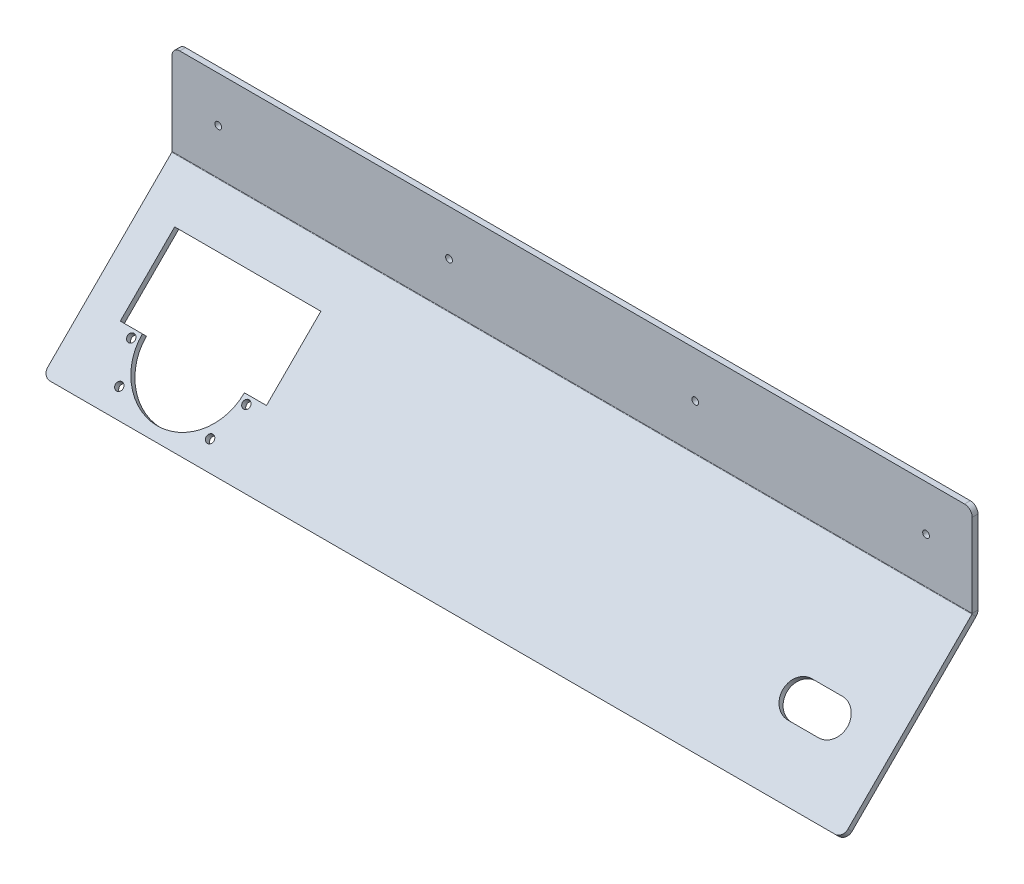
ISO-10303-21;
HEADER;
FILE_DESCRIPTION(('STEP AP214'),'2;1');
FILE_NAME('part.step','',(''),(''),'','','');
FILE_SCHEMA(('AUTOMOTIVE_DESIGN { 1 0 10303 214 1 1 1 1 }'));
ENDSEC;
DATA;
#1=APPLICATION_CONTEXT('core data for automotive mechanical design processes');
#2=APPLICATION_PROTOCOL_DEFINITION('international standard','automotive_design',2000,#1);
#3=PRODUCT_CONTEXT('',#1,'mechanical');
#4=PRODUCT('Part','Part','',(#3));
#5=PRODUCT_RELATED_PRODUCT_CATEGORY('part','',(#4));
#6=PRODUCT_DEFINITION_FORMATION('','',#4);
#7=PRODUCT_DEFINITION_CONTEXT('part definition',#1,'design');
#8=PRODUCT_DEFINITION('design','',#6,#7);
#9=PRODUCT_DEFINITION_SHAPE('','',#8);
#10=(LENGTH_UNIT() NAMED_UNIT(*) SI_UNIT(.MILLI.,.METRE.));
#11=(NAMED_UNIT(*) PLANE_ANGLE_UNIT() SI_UNIT($,.RADIAN.));
#12=(NAMED_UNIT(*) SI_UNIT($,.STERADIAN.) SOLID_ANGLE_UNIT());
#13=UNCERTAINTY_MEASURE_WITH_UNIT(LENGTH_MEASURE(1.E-05),#10,'distance_accuracy_value','');
#14=(GEOMETRIC_REPRESENTATION_CONTEXT(3) GLOBAL_UNCERTAINTY_ASSIGNED_CONTEXT((#13)) GLOBAL_UNIT_ASSIGNED_CONTEXT((#10,
#11,#12)) REPRESENTATION_CONTEXT('',''));
#15=CARTESIAN_POINT('',(0.,0.,0.));
#16=DIRECTION('',(0.,0.,1.));
#17=DIRECTION('',(1.,0.,0.));
#18=AXIS2_PLACEMENT_3D('',#15,#16,#17);
#19=CARTESIAN_POINT('',(0.,-20.7491761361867,-54.5315567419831));
#20=DIRECTION('',(0.,0.707106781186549,0.707106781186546));
#21=DIRECTION('',(1.,0.,0.));
#22=AXIS2_PLACEMENT_3D('',#19,#20,#21);
#23=PLANE('',#22);
#24=CARTESIAN_POINT('',(584.2,-141.443818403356,66.1630855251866));
#25=DIRECTION('',(0.,0.707106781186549,0.707106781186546));
#26=DIRECTION('',(0.,-0.707106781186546,0.707106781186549));
#27=AXIS2_PLACEMENT_3D('',#24,#25,#26);
#28=CIRCLE('',#27,13.97);
#29=CARTESIAN_POINT('',(584.2,-131.56553667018,56.2848037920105));
#30=VERTEX_POINT('',#29);
#31=CARTESIAN_POINT('',(584.2,-151.322100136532,76.0413672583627));
#32=VERTEX_POINT('',#31);
#33=EDGE_CURVE('E263',#30,#32,#28,.T.);
#34=ORIENTED_EDGE('',*,*,#33,.F.);
#35=DIRECTION('',(-1.,0.,0.));
#36=VECTOR('',#35,1.);
#37=CARTESIAN_POINT('',(584.2,-131.56553667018,56.2848037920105));
#38=LINE('',#37,#36);
#39=CARTESIAN_POINT('',(609.6,-131.56553667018,56.2848037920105));
#40=VERTEX_POINT('',#39);
#41=EDGE_CURVE('E267',#40,#30,#38,.T.);
#42=ORIENTED_EDGE('',*,*,#41,.F.);
#43=CARTESIAN_POINT('',(609.6,-141.443818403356,66.1630855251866));
#44=DIRECTION('',(0.,0.707106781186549,0.707106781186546));
#45=DIRECTION('',(0.,-0.707106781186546,0.707106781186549));
#46=AXIS2_PLACEMENT_3D('',#43,#44,#45);
#47=CIRCLE('',#46,13.97);
#48=CARTESIAN_POINT('',(609.6,-151.322100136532,76.0413672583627));
#49=VERTEX_POINT('',#48);
#50=EDGE_CURVE('E247',#49,#40,#47,.T.);
#51=ORIENTED_EDGE('',*,*,#50,.F.);
#52=DIRECTION('',(1.,0.,0.));
#53=VECTOR('',#52,1.);
#54=CARTESIAN_POINT('',(584.2,-151.322100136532,76.0413672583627));
#55=LINE('',#54,#53);
#56=EDGE_CURVE('E258',#32,#49,#55,.T.);
#57=ORIENTED_EDGE('',*,*,#56,.F.);
#58=EDGE_LOOP('',(#34,#42,#51,#57));
#59=FACE_BOUND('',#58,.T.);
#60=CARTESIAN_POINT('',(136.271,-150.244469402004,74.9637365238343));
#61=DIRECTION('',(0.,0.707106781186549,0.707106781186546));
#62=DIRECTION('',(1.,0.,0.));
#63=AXIS2_PLACEMENT_3D('',#60,#61,#62);
#64=CIRCLE('',#63,3.175);
#65=CARTESIAN_POINT('',(139.446,-150.244469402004,74.9637365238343));
#66=VERTEX_POINT('',#65);
#67=EDGE_CURVE('E344',#66,#66,#64,.T.);
#68=ORIENTED_EDGE('',*,*,#67,.F.);
#69=EDGE_LOOP('',(#68));
#70=FACE_BOUND('',#69,.T.);
#71=CARTESIAN_POINT('',(41.275,-150.244469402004,74.9637365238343));
#72=DIRECTION('',(0.,0.707106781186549,0.707106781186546));
#73=DIRECTION('',(1.,0.,0.));
#74=AXIS2_PLACEMENT_3D('',#71,#72,#73);
#75=CIRCLE('',#74,3.175);
#76=CARTESIAN_POINT('',(44.45,-150.244469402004,74.9637365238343));
#77=VERTEX_POINT('',#76);
#78=EDGE_CURVE('E348',#77,#77,#75,.T.);
#79=ORIENTED_EDGE('',*,*,#78,.F.);
#80=EDGE_LOOP('',(#79));
#81=FACE_BOUND('',#80,.T.);
#82=CARTESIAN_POINT('',(51.181,-170.001032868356,94.7202999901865));
#83=DIRECTION('',(0.,0.707106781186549,0.707106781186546));
#84=DIRECTION('',(1.,0.,0.));
#85=AXIS2_PLACEMENT_3D('',#82,#83,#84);
#86=CIRCLE('',#85,3.175);
#87=CARTESIAN_POINT('',(54.356,-170.001032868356,94.7202999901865));
#88=VERTEX_POINT('',#87);
#89=EDGE_CURVE('E369',#88,#88,#86,.T.);
#90=ORIENTED_EDGE('',*,*,#89,.F.);
#91=EDGE_LOOP('',(#90));
#92=FACE_BOUND('',#91,.T.);
#93=CARTESIAN_POINT('',(126.111,-170.001032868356,94.7202999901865));
#94=DIRECTION('',(0.,0.707106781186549,0.707106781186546));
#95=DIRECTION('',(1.,0.,0.));
#96=AXIS2_PLACEMENT_3D('',#93,#94,#95);
#97=CIRCLE('',#96,3.17499999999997);
#98=CARTESIAN_POINT('',(129.286,-170.001032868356,94.7202999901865));
#99=VERTEX_POINT('',#98);
#100=EDGE_CURVE('E347',#99,#99,#97,.T.);
#101=ORIENTED_EDGE('',*,*,#100,.F.);
#102=EDGE_LOOP('',(#101));
#103=FACE_BOUND('',#102,.T.);
#104=DIRECTION('',(1.,0.,0.));
#105=VECTOR('',#104,1.);
#106=CARTESIAN_POINT('',(28.448,-146.472761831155,71.1920289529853));
#107=LINE('',#106,#105);
#108=CARTESIAN_POINT('',(130.921843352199,-146.472761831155,71.1920289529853));
#109=VERTEX_POINT('',#108);
#110=CARTESIAN_POINT('',(149.098,-146.472761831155,71.1920289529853));
#111=VERTEX_POINT('',#110);
#112=EDGE_CURVE('E390',#109,#111,#107,.T.);
#113=ORIENTED_EDGE('',*,*,#112,.F.);
#114=CARTESIAN_POINT('',(88.773,-146.472761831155,71.1920289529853));
#115=DIRECTION('',(0.,-0.707106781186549,-0.707106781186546));
#116=DIRECTION('',(-1.,0.,0.));
#117=AXIS2_PLACEMENT_3D('',#114,#115,#116);
#118=CIRCLE('',#117,42.148843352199);
#119=CARTESIAN_POINT('',(46.624156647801,-146.472761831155,71.1920289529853));
#120=VERTEX_POINT('',#119);
#121=EDGE_CURVE('E355',#109,#120,#118,.T.);
#122=ORIENTED_EDGE('',*,*,#121,.T.);
#123=CARTESIAN_POINT('',(28.448,-146.472761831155,71.1920289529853));
#124=VERTEX_POINT('',#123);
#125=EDGE_CURVE('E391',#124,#120,#107,.T.);
#126=ORIENTED_EDGE('',*,*,#125,.F.);
#127=DIRECTION('',(0.,-0.707106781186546,0.707106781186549));
#128=VECTOR('',#127,1.);
#129=CARTESIAN_POINT('',(28.448,-146.472761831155,71.1920289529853));
#130=LINE('',#129,#128);
#131=CARTESIAN_POINT('',(28.448,-101.571481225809,26.2907483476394));
#132=VERTEX_POINT('',#131);
#133=EDGE_CURVE('E343',#132,#124,#130,.T.);
#134=ORIENTED_EDGE('',*,*,#133,.F.);
#135=DIRECTION('',(-1.,0.,0.));
#136=VECTOR('',#135,1.);
#137=CARTESIAN_POINT('',(28.448,-101.571481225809,26.2907483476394));
#138=LINE('',#137,#136);
#139=CARTESIAN_POINT('',(149.098,-101.571481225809,26.2907483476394));
#140=VERTEX_POINT('',#139);
#141=EDGE_CURVE('E378',#140,#132,#138,.T.);
#142=ORIENTED_EDGE('',*,*,#141,.F.);
#143=DIRECTION('',(0.,0.707106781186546,-0.707106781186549));
#144=VECTOR('',#143,1.);
#145=CARTESIAN_POINT('',(149.098,-146.472761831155,71.1920289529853));
#146=LINE('',#145,#144);
#147=EDGE_CURVE('E394',#111,#140,#146,.T.);
#148=ORIENTED_EDGE('',*,*,#147,.F.);
#149=EDGE_LOOP('',(#113,#122,#126,#134,#142,#148));
#150=FACE_BOUND('',#149,.T.);
#151=DIRECTION('',(0.,-0.707106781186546,0.707106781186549));
#152=VECTOR('',#151,1.);
#153=CARTESIAN_POINT('',(0.,-20.7491761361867,-54.5315567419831));
#154=LINE('',#153,#152);
#155=CARTESIAN_POINT('',(0.,-75.4964780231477,0.215745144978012));
#156=VERTEX_POINT('',#155);
#157=CARTESIAN_POINT('',(0.,-177.903658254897,102.622925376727));
#158=VERTEX_POINT('',#157);
#159=EDGE_CURVE('E401',#156,#158,#154,.T.);
#160=ORIENTED_EDGE('',*,*,#159,.T.);
#161=CARTESIAN_POINT('',(6.35000000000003,-177.903658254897,102.622925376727));
#162=DIRECTION('',(0.,0.707106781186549,0.707106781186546));
#163=DIRECTION('',(0.,-0.707106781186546,0.707106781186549));
#164=AXIS2_PLACEMENT_3D('',#161,#162,#163);
#165=CIRCLE('',#164,6.35);
#166=CARTESIAN_POINT('',(6.35000000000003,-182.393786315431,107.113053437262));
#167=VERTEX_POINT('',#166);
#168=EDGE_CURVE('E449',#158,#167,#165,.T.);
#169=ORIENTED_EDGE('',*,*,#168,.T.);
#170=DIRECTION('',(1.,0.,0.));
#171=VECTOR('',#170,1.);
#172=CARTESIAN_POINT('',(0.,-182.393786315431,107.113053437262));
#173=LINE('',#172,#171);
#174=CARTESIAN_POINT('',(654.05,-182.393786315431,107.113053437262));
#175=VERTEX_POINT('',#174);
#176=EDGE_CURVE('E414',#167,#175,#173,.T.);
#177=ORIENTED_EDGE('',*,*,#176,.T.);
#178=CARTESIAN_POINT('',(654.05,-177.903658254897,102.622925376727));
#179=DIRECTION('',(0.,0.707106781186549,0.707106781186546));
#180=DIRECTION('',(0.,-0.707106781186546,0.707106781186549));
#181=AXIS2_PLACEMENT_3D('',#178,#179,#180);
#182=CIRCLE('',#181,6.35);
#183=CARTESIAN_POINT('',(660.4,-177.903658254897,102.622925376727));
#184=VERTEX_POINT('',#183);
#185=EDGE_CURVE('E447',#175,#184,#182,.T.);
#186=ORIENTED_EDGE('',*,*,#185,.T.);
#187=DIRECTION('',(0.,0.707106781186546,-0.707106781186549));
#188=VECTOR('',#187,1.);
#189=CARTESIAN_POINT('',(660.4,-20.7491761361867,-54.5315567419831));
#190=LINE('',#189,#188);
#191=CARTESIAN_POINT('',(660.4,-75.4964780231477,0.215745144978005));
#192=VERTEX_POINT('',#191);
#193=EDGE_CURVE('E417',#184,#192,#190,.T.);
#194=ORIENTED_EDGE('',*,*,#193,.T.);
#195=DIRECTION('',(-1.,0.,0.));
#196=VECTOR('',#195,1.);
#197=CARTESIAN_POINT('',(0.,-75.4964780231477,0.215745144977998));
#198=LINE('',#197,#196);
#199=EDGE_CURVE('E423',#192,#156,#198,.T.);
#200=ORIENTED_EDGE('',*,*,#199,.T.);
#201=EDGE_LOOP('',(#160,#169,#177,#186,#194,#200));
#202=FACE_BOUND('',#201,.T.);
#203=ADVANCED_FACE('F91',(#59,#70,#81,#92,#103,#150,#202),#23,.T.);
#204=CARTESIAN_POINT('',(0.,-24.1167721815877,-57.899152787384));
#205=DIRECTION('',(-1.,0.,0.));
#206=DIRECTION('',(0.,-0.707106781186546,0.707106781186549));
#207=AXIS2_PLACEMENT_3D('',#204,#205,#206);
#208=PLANE('',#207);
#209=DIRECTION('',(0.,-0.707106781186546,0.707106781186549));
#210=VECTOR('',#209,1.);
#211=CARTESIAN_POINT('',(0.,-24.1167721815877,-57.899152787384));
#212=LINE('',#211,#210);
#213=CARTESIAN_POINT('',(0.,-78.8640740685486,-3.15185090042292));
#214=VERTEX_POINT('',#213);
#215=CARTESIAN_POINT('',(0.,-181.271254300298,99.2553293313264));
#216=VERTEX_POINT('',#215);
#217=EDGE_CURVE('E413',#214,#216,#212,.T.);
#218=ORIENTED_EDGE('',*,*,#217,.T.);
#219=DIRECTION('',(0.,0.707106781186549,0.707106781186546));
#220=VECTOR('',#219,1.);
#221=CARTESIAN_POINT('',(0.,-181.271254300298,99.2553293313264));
#222=LINE('',#221,#220);
#223=EDGE_CURVE('E444',#216,#158,#222,.T.);
#224=ORIENTED_EDGE('',*,*,#223,.T.);
#225=ORIENTED_EDGE('',*,*,#159,.F.);
#226=DIRECTION('',(0.,-0.707106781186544,-0.707106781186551));
#227=VECTOR('',#226,1.);
#228=CARTESIAN_POINT('',(0.,-78.8640740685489,-3.15185090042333));
#229=LINE('',#228,#227);
#230=EDGE_CURVE('E421',#156,#214,#229,.T.);
#231=ORIENTED_EDGE('',*,*,#230,.T.);
#232=EDGE_LOOP('',(#218,#224,#225,#231));
#233=FACE_BOUND('',#232,.T.);
#234=ADVANCED_FACE('F498',(#233),#208,.T.);
#235=CARTESIAN_POINT('',(660.4,-24.1167721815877,-57.899152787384));
#236=DIRECTION('',(1.,0.,0.));
#237=DIRECTION('',(0.,-0.707106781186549,-0.707106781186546));
#238=AXIS2_PLACEMENT_3D('',#235,#236,#237);
#239=PLANE('',#238);
#240=ORIENTED_EDGE('',*,*,#193,.F.);
#241=DIRECTION('',(0.,0.707106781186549,0.707106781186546));
#242=VECTOR('',#241,1.);
#243=CARTESIAN_POINT('',(660.4,-181.271254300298,99.2553293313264));
#244=LINE('',#243,#242);
#245=CARTESIAN_POINT('',(660.4,-181.271254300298,99.2553293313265));
#246=VERTEX_POINT('',#245);
#247=EDGE_CURVE('E99',#184,#246,#244,.F.);
#248=ORIENTED_EDGE('',*,*,#247,.T.);
#249=DIRECTION('',(0.,0.707106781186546,-0.707106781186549));
#250=VECTOR('',#249,1.);
#251=CARTESIAN_POINT('',(660.4,-24.1167721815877,-57.899152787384));
#252=LINE('',#251,#250);
#253=CARTESIAN_POINT('',(660.4,-78.8640740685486,-3.15185090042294));
#254=VERTEX_POINT('',#253);
#255=EDGE_CURVE('E412',#246,#254,#252,.T.);
#256=ORIENTED_EDGE('',*,*,#255,.T.);
#257=DIRECTION('',(0.,0.707106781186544,0.707106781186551));
#258=VECTOR('',#257,1.);
#259=CARTESIAN_POINT('',(660.4,-78.864074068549,-3.15185090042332));
#260=LINE('',#259,#258);
#261=EDGE_CURVE('E426',#254,#192,#260,.T.);
#262=ORIENTED_EDGE('',*,*,#261,.T.);
#263=EDGE_LOOP('',(#240,#248,#256,#262));
#264=FACE_BOUND('',#263,.T.);
#265=ADVANCED_FACE('F476',(#264),#239,.T.);
#266=CARTESIAN_POINT('',(0.,-24.1167721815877,-57.899152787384));
#267=DIRECTION('',(0.,0.707106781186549,0.707106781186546));
#268=DIRECTION('',(1.,0.,0.));
#269=AXIS2_PLACEMENT_3D('',#266,#267,#268);
#270=PLANE('',#269);
#271=DIRECTION('',(-1.,0.,0.));
#272=VECTOR('',#271,1.);
#273=CARTESIAN_POINT('',(1.20586585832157E-13,-134.933132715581,52.9172077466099));
#274=LINE('',#273,#272);
#275=CARTESIAN_POINT('',(609.6,-134.933132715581,52.9172077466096));
#276=VERTEX_POINT('',#275);
#277=CARTESIAN_POINT('',(584.2,-134.933132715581,52.9172077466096));
#278=VERTEX_POINT('',#277);
#279=EDGE_CURVE('E438',#276,#278,#274,.T.);
#280=ORIENTED_EDGE('',*,*,#279,.T.);
#281=CARTESIAN_POINT('',(584.2,-144.811414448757,62.7954894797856));
#282=DIRECTION('',(0.,0.707106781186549,0.707106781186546));
#283=DIRECTION('',(0.,-0.707106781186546,0.707106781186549));
#284=AXIS2_PLACEMENT_3D('',#281,#282,#283);
#285=CIRCLE('',#284,13.97);
#286=CARTESIAN_POINT('',(584.2,-154.689696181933,72.6737712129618));
#287=VERTEX_POINT('',#286);
#288=EDGE_CURVE('E441',#278,#287,#285,.T.);
#289=ORIENTED_EDGE('',*,*,#288,.T.);
#290=DIRECTION('',(1.,0.,0.));
#291=VECTOR('',#290,1.);
#292=CARTESIAN_POINT('',(0.,-154.689696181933,72.6737712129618));
#293=LINE('',#292,#291);
#294=CARTESIAN_POINT('',(609.6,-154.689696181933,72.6737712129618));
#295=VERTEX_POINT('',#294);
#296=EDGE_CURVE('E429',#287,#295,#293,.T.);
#297=ORIENTED_EDGE('',*,*,#296,.T.);
#298=CARTESIAN_POINT('',(609.6,-144.811414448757,62.7954894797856));
#299=DIRECTION('',(0.,0.707106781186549,0.707106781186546));
#300=DIRECTION('',(0.,-0.707106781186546,0.707106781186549));
#301=AXIS2_PLACEMENT_3D('',#298,#299,#300);
#302=CIRCLE('',#301,13.97);
#303=EDGE_CURVE('E250',#295,#276,#302,.T.);
#304=ORIENTED_EDGE('',*,*,#303,.T.);
#305=EDGE_LOOP('',(#280,#289,#297,#304));
#306=FACE_BOUND('',#305,.T.);
#307=DIRECTION('',(1.,0.,0.));
#308=VECTOR('',#307,1.);
#309=CARTESIAN_POINT('',(0.,-185.761382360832,103.745457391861));
#310=LINE('',#309,#308);
#311=CARTESIAN_POINT('',(6.35000000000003,-185.761382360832,103.745457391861));
#312=VERTEX_POINT('',#311);
#313=CARTESIAN_POINT('',(654.05,-185.761382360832,103.745457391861));
#314=VERTEX_POINT('',#313);
#315=EDGE_CURVE('E409',#312,#314,#310,.T.);
#316=ORIENTED_EDGE('',*,*,#315,.F.);
#317=CARTESIAN_POINT('',(6.35000000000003,-181.271254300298,99.2553293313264));
#318=DIRECTION('',(0.,0.707106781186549,0.707106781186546));
#319=DIRECTION('',(0.,-0.707106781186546,0.707106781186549));
#320=AXIS2_PLACEMENT_3D('',#317,#318,#319);
#321=CIRCLE('',#320,6.35);
#322=EDGE_CURVE('E458',#312,#216,#321,.F.);
#323=ORIENTED_EDGE('',*,*,#322,.T.);
#324=ORIENTED_EDGE('',*,*,#217,.F.);
#325=DIRECTION('',(-1.,0.,0.));
#326=VECTOR('',#325,1.);
#327=CARTESIAN_POINT('',(0.,-78.8640740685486,-3.15185090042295));
#328=LINE('',#327,#326);
#329=EDGE_CURVE('E418',#254,#214,#328,.T.);
#330=ORIENTED_EDGE('',*,*,#329,.F.);
#331=ORIENTED_EDGE('',*,*,#255,.F.);
#332=CARTESIAN_POINT('',(654.05,-181.271254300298,99.2553293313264));
#333=DIRECTION('',(0.,0.707106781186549,0.707106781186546));
#334=DIRECTION('',(0.,-0.707106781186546,0.707106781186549));
#335=AXIS2_PLACEMENT_3D('',#332,#333,#334);
#336=CIRCLE('',#335,6.35);
#337=EDGE_CURVE('E456',#246,#314,#336,.F.);
#338=ORIENTED_EDGE('',*,*,#337,.T.);
#339=EDGE_LOOP('',(#316,#323,#324,#330,#331,#338));
#340=FACE_BOUND('',#339,.T.);
#341=CARTESIAN_POINT('',(136.271,-153.612065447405,71.5961404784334));
#342=DIRECTION('',(0.,0.707106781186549,0.707106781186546));
#343=DIRECTION('',(1.,0.,0.));
#344=AXIS2_PLACEMENT_3D('',#341,#342,#343);
#345=CIRCLE('',#344,3.175);
#346=CARTESIAN_POINT('',(139.446,-153.612065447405,71.5961404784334));
#347=VERTEX_POINT('',#346);
#348=EDGE_CURVE('E340',#347,#347,#345,.T.);
#349=ORIENTED_EDGE('',*,*,#348,.T.);
#350=EDGE_LOOP('',(#349));
#351=FACE_BOUND('',#350,.T.);
#352=CARTESIAN_POINT('',(126.111,-173.368628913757,91.3527039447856));
#353=DIRECTION('',(0.,0.707106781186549,0.707106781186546));
#354=DIRECTION('',(1.,0.,0.));
#355=AXIS2_PLACEMENT_3D('',#352,#353,#354);
#356=CIRCLE('',#355,3.17499999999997);
#357=CARTESIAN_POINT('',(129.286,-173.368628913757,91.3527039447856));
#358=VERTEX_POINT('',#357);
#359=EDGE_CURVE('E366',#358,#358,#356,.T.);
#360=ORIENTED_EDGE('',*,*,#359,.T.);
#361=EDGE_LOOP('',(#360));
#362=FACE_BOUND('',#361,.T.);
#363=CARTESIAN_POINT('',(51.181,-173.368628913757,91.3527039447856));
#364=DIRECTION('',(0.,0.707106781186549,0.707106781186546));
#365=DIRECTION('',(1.,0.,0.));
#366=AXIS2_PLACEMENT_3D('',#363,#364,#365);
#367=CIRCLE('',#366,3.175);
#368=CARTESIAN_POINT('',(54.356,-173.368628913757,91.3527039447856));
#369=VERTEX_POINT('',#368);
#370=EDGE_CURVE('E351',#369,#369,#367,.T.);
#371=ORIENTED_EDGE('',*,*,#370,.T.);
#372=EDGE_LOOP('',(#371));
#373=FACE_BOUND('',#372,.T.);
#374=CARTESIAN_POINT('',(41.275,-153.612065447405,71.5961404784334));
#375=DIRECTION('',(0.,0.707106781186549,0.707106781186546));
#376=DIRECTION('',(1.,0.,0.));
#377=AXIS2_PLACEMENT_3D('',#374,#375,#376);
#378=CIRCLE('',#377,3.175);
#379=CARTESIAN_POINT('',(44.45,-153.612065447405,71.5961404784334));
#380=VERTEX_POINT('',#379);
#381=EDGE_CURVE('E352',#380,#380,#378,.T.);
#382=ORIENTED_EDGE('',*,*,#381,.T.);
#383=EDGE_LOOP('',(#382));
#384=FACE_BOUND('',#383,.T.);
#385=CARTESIAN_POINT('',(88.773,-149.840357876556,67.8244329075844));
#386=DIRECTION('',(0.,-0.707106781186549,-0.707106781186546));
#387=DIRECTION('',(-1.,0.,0.));
#388=AXIS2_PLACEMENT_3D('',#385,#386,#387);
#389=CIRCLE('',#388,42.148843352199);
#390=CARTESIAN_POINT('',(130.921843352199,-149.840357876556,67.8244329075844));
#391=VERTEX_POINT('',#390);
#392=CARTESIAN_POINT('',(46.624156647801,-149.840357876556,67.8244329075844));
#393=VERTEX_POINT('',#392);
#394=EDGE_CURVE('E358',#391,#393,#389,.T.);
#395=ORIENTED_EDGE('',*,*,#394,.F.);
#396=DIRECTION('',(1.,0.,0.));
#397=VECTOR('',#396,1.);
#398=CARTESIAN_POINT('',(28.448,-149.840357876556,67.8244329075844));
#399=LINE('',#398,#397);
#400=CARTESIAN_POINT('',(149.098,-149.840357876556,67.8244329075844));
#401=VERTEX_POINT('',#400);
#402=EDGE_CURVE('E377',#391,#401,#399,.T.);
#403=ORIENTED_EDGE('',*,*,#402,.T.);
#404=DIRECTION('',(0.,0.707106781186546,-0.707106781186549));
#405=VECTOR('',#404,1.);
#406=CARTESIAN_POINT('',(149.098,-149.840357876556,67.8244329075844));
#407=LINE('',#406,#405);
#408=CARTESIAN_POINT('',(149.098,-104.93907727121,22.9231523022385));
#409=VERTEX_POINT('',#408);
#410=EDGE_CURVE('E382',#401,#409,#407,.T.);
#411=ORIENTED_EDGE('',*,*,#410,.T.);
#412=DIRECTION('',(-1.,0.,0.));
#413=VECTOR('',#412,1.);
#414=CARTESIAN_POINT('',(28.448,-104.93907727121,22.9231523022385));
#415=LINE('',#414,#413);
#416=CARTESIAN_POINT('',(28.448,-104.93907727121,22.9231523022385));
#417=VERTEX_POINT('',#416);
#418=EDGE_CURVE('E385',#409,#417,#415,.T.);
#419=ORIENTED_EDGE('',*,*,#418,.T.);
#420=DIRECTION('',(0.,-0.707106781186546,0.707106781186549));
#421=VECTOR('',#420,1.);
#422=CARTESIAN_POINT('',(28.448,-149.840357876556,67.8244329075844));
#423=LINE('',#422,#421);
#424=CARTESIAN_POINT('',(28.448,-149.840357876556,67.8244329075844));
#425=VERTEX_POINT('',#424);
#426=EDGE_CURVE('E374',#417,#425,#423,.T.);
#427=ORIENTED_EDGE('',*,*,#426,.T.);
#428=EDGE_CURVE('E379',#425,#393,#399,.T.);
#429=ORIENTED_EDGE('',*,*,#428,.T.);
#430=EDGE_LOOP('',(#395,#403,#411,#419,#427,#429));
#431=FACE_BOUND('',#430,.T.);
#432=ADVANCED_FACE('F482',(#306,#340,#351,#362,#373,#384,#431),#270,.F.);
#433=CARTESIAN_POINT('',(28.448,-149.840357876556,67.8244329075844));
#434=DIRECTION('',(0.,-0.707106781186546,0.707106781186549));
#435=DIRECTION('',(0.,-0.707106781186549,-0.707106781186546));
#436=AXIS2_PLACEMENT_3D('',#433,#434,#435);
#437=PLANE('',#436);
#438=DIRECTION('',(0.,0.707106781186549,0.707106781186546));
#439=VECTOR('',#438,1.);
#440=CARTESIAN_POINT('',(130.921843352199,-149.840357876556,67.8244329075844));
#441=LINE('',#440,#439);
#442=EDGE_CURVE('E315',#391,#109,#441,.T.);
#443=ORIENTED_EDGE('',*,*,#442,.T.);
#444=ORIENTED_EDGE('',*,*,#112,.T.);
#445=DIRECTION('',(0.,0.707106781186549,0.707106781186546));
#446=VECTOR('',#445,1.);
#447=CARTESIAN_POINT('',(149.098,-149.840357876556,67.8244329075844));
#448=LINE('',#447,#446);
#449=EDGE_CURVE('E404',#401,#111,#448,.T.);
#450=ORIENTED_EDGE('',*,*,#449,.F.);
#451=ORIENTED_EDGE('',*,*,#402,.F.);
#452=EDGE_LOOP('',(#443,#444,#450,#451));
#453=FACE_BOUND('',#452,.T.);
#454=ADVANCED_FACE('F685',(#453),#437,.F.);
#455=DIRECTION('',(0.,0.707106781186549,0.707106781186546));
#456=VECTOR('',#455,1.);
#457=CARTESIAN_POINT('',(46.624156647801,-149.840357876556,67.8244329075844));
#458=LINE('',#457,#456);
#459=EDGE_CURVE('E356',#393,#120,#458,.T.);
#460=ORIENTED_EDGE('',*,*,#459,.F.);
#461=ORIENTED_EDGE('',*,*,#428,.F.);
#462=DIRECTION('',(0.,0.707106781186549,0.707106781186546));
#463=VECTOR('',#462,1.);
#464=CARTESIAN_POINT('',(28.448,-149.840357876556,67.8244329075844));
#465=LINE('',#464,#463);
#466=EDGE_CURVE('E388',#425,#124,#465,.T.);
#467=ORIENTED_EDGE('',*,*,#466,.T.);
#468=ORIENTED_EDGE('',*,*,#125,.T.);
#469=EDGE_LOOP('',(#460,#461,#467,#468));
#470=FACE_BOUND('',#469,.T.);
#471=ADVANCED_FACE('F574',(#470),#437,.F.);
#472=CARTESIAN_POINT('',(0.,-185.761382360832,103.745457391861));
#473=DIRECTION('',(0.,-0.707106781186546,0.707106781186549));
#474=DIRECTION('',(0.,-0.707106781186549,-0.707106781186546));
#475=AXIS2_PLACEMENT_3D('',#472,#473,#474);
#476=PLANE('',#475);
#477=ORIENTED_EDGE('',*,*,#176,.F.);
#478=DIRECTION('',(0.,0.707106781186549,0.707106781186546));
#479=VECTOR('',#478,1.);
#480=CARTESIAN_POINT('',(6.35000000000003,-185.761382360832,103.745457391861));
#481=LINE('',#480,#479);
#482=EDGE_CURVE('E454',#167,#312,#481,.F.);
#483=ORIENTED_EDGE('',*,*,#482,.T.);
#484=ORIENTED_EDGE('',*,*,#315,.T.);
#485=DIRECTION('',(0.,0.707106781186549,0.707106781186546));
#486=VECTOR('',#485,1.);
#487=CARTESIAN_POINT('',(654.05,-185.761382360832,103.745457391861));
#488=LINE('',#487,#486);
#489=EDGE_CURVE('E451',#314,#175,#488,.T.);
#490=ORIENTED_EDGE('',*,*,#489,.T.);
#491=EDGE_LOOP('',(#477,#483,#484,#490));
#492=FACE_BOUND('',#491,.T.);
#493=ADVANCED_FACE('F490',(#492),#476,.T.);
#494=CARTESIAN_POINT('',(28.448,-149.840357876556,67.8244329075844));
#495=DIRECTION('',(-1.,0.,0.));
#496=DIRECTION('',(0.,0.707106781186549,0.707106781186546));
#497=AXIS2_PLACEMENT_3D('',#494,#495,#496);
#498=PLANE('',#497);
#499=ORIENTED_EDGE('',*,*,#133,.T.);
#500=ORIENTED_EDGE('',*,*,#466,.F.);
#501=ORIENTED_EDGE('',*,*,#426,.F.);
#502=DIRECTION('',(0.,0.707106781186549,0.707106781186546));
#503=VECTOR('',#502,1.);
#504=CARTESIAN_POINT('',(28.448,-104.93907727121,22.9231523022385));
#505=LINE('',#504,#503);
#506=EDGE_CURVE('E399',#417,#132,#505,.T.);
#507=ORIENTED_EDGE('',*,*,#506,.T.);
#508=EDGE_LOOP('',(#499,#500,#501,#507));
#509=FACE_BOUND('',#508,.T.);
#510=ADVANCED_FACE('F573',(#509),#498,.F.);
#511=CARTESIAN_POINT('',(28.448,-104.93907727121,22.9231523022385));
#512=DIRECTION('',(0.,0.707106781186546,-0.707106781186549));
#513=DIRECTION('',(0.,0.707106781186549,0.707106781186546));
#514=AXIS2_PLACEMENT_3D('',#511,#512,#513);
#515=PLANE('',#514);
#516=ORIENTED_EDGE('',*,*,#141,.T.);
#517=ORIENTED_EDGE('',*,*,#506,.F.);
#518=ORIENTED_EDGE('',*,*,#418,.F.);
#519=DIRECTION('',(0.,0.707106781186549,0.707106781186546));
#520=VECTOR('',#519,1.);
#521=CARTESIAN_POINT('',(149.098,-104.93907727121,22.9231523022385));
#522=LINE('',#521,#520);
#523=EDGE_CURVE('E402',#409,#140,#522,.T.);
#524=ORIENTED_EDGE('',*,*,#523,.T.);
#525=EDGE_LOOP('',(#516,#517,#518,#524));
#526=FACE_BOUND('',#525,.T.);
#527=ADVANCED_FACE('F754',(#526),#515,.F.);
#528=CARTESIAN_POINT('',(149.098,-149.840357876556,67.8244329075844));
#529=DIRECTION('',(1.,0.,0.));
#530=DIRECTION('',(0.,0.707106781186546,-0.707106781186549));
#531=AXIS2_PLACEMENT_3D('',#528,#529,#530);
#532=PLANE('',#531);
#533=ORIENTED_EDGE('',*,*,#147,.T.);
#534=ORIENTED_EDGE('',*,*,#523,.F.);
#535=ORIENTED_EDGE('',*,*,#410,.F.);
#536=ORIENTED_EDGE('',*,*,#449,.T.);
#537=EDGE_LOOP('',(#533,#534,#535,#536));
#538=FACE_BOUND('',#537,.T.);
#539=ADVANCED_FACE('F745',(#538),#532,.F.);
#540=CARTESIAN_POINT('',(88.773,-149.840357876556,67.8244329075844));
#541=DIRECTION('',(0.,0.707106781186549,0.707106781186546));
#542=DIRECTION('',(1.,0.,0.));
#543=AXIS2_PLACEMENT_3D('',#540,#541,#542);
#544=CYLINDRICAL_SURFACE('',#543,42.148843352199);
#545=ORIENTED_EDGE('',*,*,#442,.F.);
#546=ORIENTED_EDGE('',*,*,#394,.T.);
#547=ORIENTED_EDGE('',*,*,#459,.T.);
#548=ORIENTED_EDGE('',*,*,#121,.F.);
#549=EDGE_LOOP('',(#545,#546,#547,#548));
#550=FACE_BOUND('',#549,.T.);
#551=ADVANCED_FACE('F737',(#550),#544,.F.);
#552=CARTESIAN_POINT('',(126.111,-173.368628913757,91.3527039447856));
#553=DIRECTION('',(0.,0.707106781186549,0.707106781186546));
#554=DIRECTION('',(1.,0.,0.));
#555=AXIS2_PLACEMENT_3D('',#552,#553,#554);
#556=CYLINDRICAL_SURFACE('',#555,3.17499999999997);
#557=ORIENTED_EDGE('',*,*,#359,.F.);
#558=EDGE_LOOP('',(#557));
#559=FACE_BOUND('',#558,.T.);
#560=ORIENTED_EDGE('',*,*,#100,.T.);
#561=EDGE_LOOP('',(#560));
#562=FACE_BOUND('',#561,.T.);
#563=ADVANCED_FACE('F730',(#559,#562),#556,.F.);
#564=CARTESIAN_POINT('',(51.181,-173.368628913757,91.3527039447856));
#565=DIRECTION('',(0.,0.707106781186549,0.707106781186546));
#566=DIRECTION('',(1.,0.,0.));
#567=AXIS2_PLACEMENT_3D('',#564,#565,#566);
#568=CYLINDRICAL_SURFACE('',#567,3.175);
#569=ORIENTED_EDGE('',*,*,#370,.F.);
#570=EDGE_LOOP('',(#569));
#571=FACE_BOUND('',#570,.T.);
#572=ORIENTED_EDGE('',*,*,#89,.T.);
#573=EDGE_LOOP('',(#572));
#574=FACE_BOUND('',#573,.T.);
#575=ADVANCED_FACE('F723',(#571,#574),#568,.F.);
#576=CARTESIAN_POINT('',(41.275,-153.612065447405,71.5961404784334));
#577=DIRECTION('',(0.,0.707106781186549,0.707106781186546));
#578=DIRECTION('',(1.,0.,0.));
#579=AXIS2_PLACEMENT_3D('',#576,#577,#578);
#580=CYLINDRICAL_SURFACE('',#579,3.175);
#581=ORIENTED_EDGE('',*,*,#381,.F.);
#582=EDGE_LOOP('',(#581));
#583=FACE_BOUND('',#582,.T.);
#584=ORIENTED_EDGE('',*,*,#78,.T.);
#585=EDGE_LOOP('',(#584));
#586=FACE_BOUND('',#585,.T.);
#587=ADVANCED_FACE('F713',(#583,#586),#580,.F.);
#588=CARTESIAN_POINT('',(136.271,-153.612065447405,71.5961404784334));
#589=DIRECTION('',(0.,0.707106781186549,0.707106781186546));
#590=DIRECTION('',(1.,0.,0.));
#591=AXIS2_PLACEMENT_3D('',#588,#589,#590);
#592=CYLINDRICAL_SURFACE('',#591,3.175);
#593=ORIENTED_EDGE('',*,*,#348,.F.);
#594=EDGE_LOOP('',(#593));
#595=FACE_BOUND('',#594,.T.);
#596=ORIENTED_EDGE('',*,*,#67,.T.);
#597=EDGE_LOOP('',(#596));
#598=FACE_BOUND('',#597,.T.);
#599=ADVANCED_FACE('F704',(#595,#598),#592,.F.);
#600=CARTESIAN_POINT('',(0.,0.,-4.7625));
#601=DIRECTION('',(0.,1.,0.));
#602=DIRECTION('',(0.,0.,1.));
#603=AXIS2_PLACEMENT_3D('',#600,#601,#602);
#604=PLANE('',#603);
#605=DIRECTION('',(-1.,0.,0.));
#606=VECTOR('',#605,1.);
#607=CARTESIAN_POINT('',(0.,0.,-4.7625));
#608=LINE('',#607,#606);
#609=CARTESIAN_POINT('',(654.05,0.,-4.7625));
#610=VERTEX_POINT('',#609);
#611=CARTESIAN_POINT('',(6.35,0.,-4.7625));
#612=VERTEX_POINT('',#611);
#613=EDGE_CURVE('E329',#610,#612,#608,.T.);
#614=ORIENTED_EDGE('',*,*,#613,.T.);
#615=DIRECTION('',(0.,0.,1.));
#616=VECTOR('',#615,1.);
#617=CARTESIAN_POINT('',(6.35,0.,-4.7625));
#618=LINE('',#617,#616);
#619=CARTESIAN_POINT('',(6.35,0.,0.));
#620=VERTEX_POINT('',#619);
#621=EDGE_CURVE('E462',#612,#620,#618,.T.);
#622=ORIENTED_EDGE('',*,*,#621,.T.);
#623=DIRECTION('',(-1.,0.,0.));
#624=VECTOR('',#623,1.);
#625=CARTESIAN_POINT('',(0.,0.,0.));
#626=LINE('',#625,#624);
#627=CARTESIAN_POINT('',(654.05,0.,0.));
#628=VERTEX_POINT('',#627);
#629=EDGE_CURVE('E318',#628,#620,#626,.T.);
#630=ORIENTED_EDGE('',*,*,#629,.F.);
#631=DIRECTION('',(0.,0.,1.));
#632=VECTOR('',#631,1.);
#633=CARTESIAN_POINT('',(654.05,0.,-4.7625));
#634=LINE('',#633,#632);
#635=EDGE_CURVE('E460',#628,#610,#634,.F.);
#636=ORIENTED_EDGE('',*,*,#635,.T.);
#637=EDGE_LOOP('',(#614,#622,#630,#636));
#638=FACE_BOUND('',#637,.T.);
#639=ADVANCED_FACE('F530',(#638),#604,.T.);
#640=CARTESIAN_POINT('',(0.,0.,-4.7625));
#641=DIRECTION('',(0.,0.,1.));
#642=DIRECTION('',(1.,0.,0.));
#643=AXIS2_PLACEMENT_3D('',#640,#641,#642);
#644=PLANE('',#643);
#645=CARTESIAN_POINT('',(38.1,-37.4878115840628,-4.7625));
#646=DIRECTION('',(0.,0.,1.));
#647=DIRECTION('',(1.,0.,0.));
#648=AXIS2_PLACEMENT_3D('',#645,#646,#647);
#649=CIRCLE('',#648,2.794);
#650=CARTESIAN_POINT('',(40.894,-37.4878115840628,-4.7625));
#651=VERTEX_POINT('',#650);
#652=EDGE_CURVE('E277',#651,#651,#649,.T.);
#653=ORIENTED_EDGE('',*,*,#652,.T.);
#654=EDGE_LOOP('',(#653));
#655=FACE_BOUND('',#654,.T.);
#656=CARTESIAN_POINT('',(228.6,-37.4878115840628,-4.7625));
#657=DIRECTION('',(0.,0.,1.));
#658=DIRECTION('',(1.,0.,0.));
#659=AXIS2_PLACEMENT_3D('',#656,#657,#658);
#660=CIRCLE('',#659,2.79399999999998);
#661=CARTESIAN_POINT('',(231.394,-37.4878115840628,-4.7625));
#662=VERTEX_POINT('',#661);
#663=EDGE_CURVE('E284',#662,#662,#660,.T.);
#664=ORIENTED_EDGE('',*,*,#663,.T.);
#665=EDGE_LOOP('',(#664));
#666=FACE_BOUND('',#665,.T.);
#667=CARTESIAN_POINT('',(431.8,-37.4878115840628,-4.7625));
#668=DIRECTION('',(0.,0.,1.));
#669=DIRECTION('',(1.,0.,0.));
#670=AXIS2_PLACEMENT_3D('',#667,#668,#669);
#671=CIRCLE('',#670,2.79400000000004);
#672=CARTESIAN_POINT('',(434.594,-37.4878115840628,-4.7625));
#673=VERTEX_POINT('',#672);
#674=EDGE_CURVE('E290',#673,#673,#671,.T.);
#675=ORIENTED_EDGE('',*,*,#674,.T.);
#676=EDGE_LOOP('',(#675));
#677=FACE_BOUND('',#676,.T.);
#678=CARTESIAN_POINT('',(622.3,-37.4878115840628,-4.7625));
#679=DIRECTION('',(0.,0.,1.));
#680=DIRECTION('',(1.,0.,0.));
#681=AXIS2_PLACEMENT_3D('',#678,#679,#680);
#682=CIRCLE('',#681,2.79399999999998);
#683=CARTESIAN_POINT('',(625.094,-37.4878115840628,-4.7625));
#684=VERTEX_POINT('',#683);
#685=EDGE_CURVE('E296',#684,#684,#682,.T.);
#686=ORIENTED_EDGE('',*,*,#685,.T.);
#687=EDGE_LOOP('',(#686));
#688=FACE_BOUND('',#687,.T.);
#689=DIRECTION('',(0.,-1.,0.));
#690=VECTOR('',#689,1.);
#691=CARTESIAN_POINT('',(0.,0.,-4.7625));
#692=LINE('',#691,#690);
#693=CARTESIAN_POINT('',(0.,-6.35,-4.7625));
#694=VERTEX_POINT('',#693);
#695=CARTESIAN_POINT('',(0.,-74.9756231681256,-4.7625));
#696=VERTEX_POINT('',#695);
#697=EDGE_CURVE('E324',#694,#696,#692,.T.);
#698=ORIENTED_EDGE('',*,*,#697,.F.);
#699=CARTESIAN_POINT('',(6.35,-6.35,-4.7625));
#700=DIRECTION('',(0.,0.,1.));
#701=DIRECTION('',(1.,0.,0.));
#702=AXIS2_PLACEMENT_3D('',#699,#700,#701);
#703=CIRCLE('',#702,6.35);
#704=EDGE_CURVE('E471',#694,#612,#703,.F.);
#705=ORIENTED_EDGE('',*,*,#704,.T.);
#706=ORIENTED_EDGE('',*,*,#613,.F.);
#707=CARTESIAN_POINT('',(654.05,-6.35,-4.7625));
#708=DIRECTION('',(0.,0.,1.));
#709=DIRECTION('',(1.,0.,0.));
#710=AXIS2_PLACEMENT_3D('',#707,#708,#709);
#711=CIRCLE('',#710,6.35);
#712=CARTESIAN_POINT('',(660.4,-6.35,-4.7625));
#713=VERTEX_POINT('',#712);
#714=EDGE_CURVE('E106',#610,#713,#711,.F.);
#715=ORIENTED_EDGE('',*,*,#714,.T.);
#716=DIRECTION('',(0.,1.,0.));
#717=VECTOR('',#716,1.);
#718=CARTESIAN_POINT('',(660.4,0.,-4.7625));
#719=LINE('',#718,#717);
#720=CARTESIAN_POINT('',(660.4,-74.9756231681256,-4.7625));
#721=VERTEX_POINT('',#720);
#722=EDGE_CURVE('E313',#721,#713,#719,.T.);
#723=ORIENTED_EDGE('',*,*,#722,.F.);
#724=DIRECTION('',(-1.,0.,0.));
#725=VECTOR('',#724,1.);
#726=CARTESIAN_POINT('',(0.,-74.9756231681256,-4.7625));
#727=LINE('',#726,#725);
#728=EDGE_CURVE('E326',#721,#696,#727,.T.);
#729=ORIENTED_EDGE('',*,*,#728,.T.);
#730=EDGE_LOOP('',(#698,#705,#706,#715,#723,#729));
#731=FACE_BOUND('',#730,.T.);
#732=ADVANCED_FACE('F511',(#655,#666,#677,#688,#731),#644,.F.);
#733=CARTESIAN_POINT('',(0.,0.,-4.7625));
#734=DIRECTION('',(-1.,0.,0.));
#735=DIRECTION('',(0.,-1.,0.));
#736=AXIS2_PLACEMENT_3D('',#733,#734,#735);
#737=PLANE('',#736);
#738=DIRECTION('',(0.,-1.,0.));
#739=VECTOR('',#738,1.);
#740=CARTESIAN_POINT('',(0.,0.,0.));
#741=LINE('',#740,#739);
#742=CARTESIAN_POINT('',(0.,-6.35,0.));
#743=VERTEX_POINT('',#742);
#744=CARTESIAN_POINT('',(0.,-74.9756231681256,0.));
#745=VERTEX_POINT('',#744);
#746=EDGE_CURVE('E316',#743,#745,#741,.T.);
#747=ORIENTED_EDGE('',*,*,#746,.F.);
#748=DIRECTION('',(0.,0.,1.));
#749=VECTOR('',#748,1.);
#750=CARTESIAN_POINT('',(0.,-6.35,-4.7625));
#751=LINE('',#750,#749);
#752=EDGE_CURVE('E114',#743,#694,#751,.F.);
#753=ORIENTED_EDGE('',*,*,#752,.T.);
#754=ORIENTED_EDGE('',*,*,#697,.T.);
#755=DIRECTION('',(0.,0.,-1.));
#756=VECTOR('',#755,1.);
#757=CARTESIAN_POINT('',(0.,-74.9756231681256,-4.76250000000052));
#758=LINE('',#757,#756);
#759=EDGE_CURVE('E332',#745,#696,#758,.T.);
#760=ORIENTED_EDGE('',*,*,#759,.F.);
#761=EDGE_LOOP('',(#747,#753,#754,#760));
#762=FACE_BOUND('',#761,.T.);
#763=ADVANCED_FACE('F509',(#762),#737,.T.);
#764=CARTESIAN_POINT('',(0.,0.,0.));
#765=DIRECTION('',(0.,0.,1.));
#766=DIRECTION('',(1.,0.,0.));
#767=AXIS2_PLACEMENT_3D('',#764,#765,#766);
#768=PLANE('',#767);
#769=CARTESIAN_POINT('',(38.1,-37.4878115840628,0.));
#770=DIRECTION('',(0.,0.,1.));
#771=DIRECTION('',(1.,0.,0.));
#772=AXIS2_PLACEMENT_3D('',#769,#770,#771);
#773=CIRCLE('',#772,2.794);
#774=CARTESIAN_POINT('',(40.894,-37.4878115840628,0.));
#775=VERTEX_POINT('',#774);
#776=EDGE_CURVE('E281',#775,#775,#773,.T.);
#777=ORIENTED_EDGE('',*,*,#776,.F.);
#778=EDGE_LOOP('',(#777));
#779=FACE_BOUND('',#778,.T.);
#780=CARTESIAN_POINT('',(228.6,-37.4878115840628,0.));
#781=DIRECTION('',(0.,0.,1.));
#782=DIRECTION('',(1.,0.,0.));
#783=AXIS2_PLACEMENT_3D('',#780,#781,#782);
#784=CIRCLE('',#783,2.79399999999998);
#785=CARTESIAN_POINT('',(231.394,-37.4878115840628,0.));
#786=VERTEX_POINT('',#785);
#787=EDGE_CURVE('E287',#786,#786,#784,.T.);
#788=ORIENTED_EDGE('',*,*,#787,.F.);
#789=EDGE_LOOP('',(#788));
#790=FACE_BOUND('',#789,.T.);
#791=CARTESIAN_POINT('',(431.8,-37.4878115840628,0.));
#792=DIRECTION('',(0.,0.,1.));
#793=DIRECTION('',(1.,0.,0.));
#794=AXIS2_PLACEMENT_3D('',#791,#792,#793);
#795=CIRCLE('',#794,2.79400000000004);
#796=CARTESIAN_POINT('',(434.594,-37.4878115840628,0.));
#797=VERTEX_POINT('',#796);
#798=EDGE_CURVE('E293',#797,#797,#795,.T.);
#799=ORIENTED_EDGE('',*,*,#798,.F.);
#800=EDGE_LOOP('',(#799));
#801=FACE_BOUND('',#800,.T.);
#802=CARTESIAN_POINT('',(622.3,-37.4878115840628,0.));
#803=DIRECTION('',(0.,0.,1.));
#804=DIRECTION('',(1.,0.,0.));
#805=AXIS2_PLACEMENT_3D('',#802,#803,#804);
#806=CIRCLE('',#805,2.79399999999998);
#807=CARTESIAN_POINT('',(625.094,-37.4878115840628,0.));
#808=VERTEX_POINT('',#807);
#809=EDGE_CURVE('E274',#808,#808,#806,.T.);
#810=ORIENTED_EDGE('',*,*,#809,.F.);
#811=EDGE_LOOP('',(#810));
#812=FACE_BOUND('',#811,.T.);
#813=ORIENTED_EDGE('',*,*,#629,.T.);
#814=CARTESIAN_POINT('',(6.35,-6.35,0.));
#815=DIRECTION('',(0.,0.,1.));
#816=DIRECTION('',(1.,0.,0.));
#817=AXIS2_PLACEMENT_3D('',#814,#815,#816);
#818=CIRCLE('',#817,6.35);
#819=EDGE_CURVE('E467',#620,#743,#818,.T.);
#820=ORIENTED_EDGE('',*,*,#819,.T.);
#821=ORIENTED_EDGE('',*,*,#746,.T.);
#822=DIRECTION('',(-1.,0.,0.));
#823=VECTOR('',#822,1.);
#824=CARTESIAN_POINT('',(0.,-74.9756231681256,0.));
#825=LINE('',#824,#823);
#826=CARTESIAN_POINT('',(660.4,-74.9756231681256,0.));
#827=VERTEX_POINT('',#826);
#828=EDGE_CURVE('E335',#827,#745,#825,.T.);
#829=ORIENTED_EDGE('',*,*,#828,.F.);
#830=DIRECTION('',(0.,1.,0.));
#831=VECTOR('',#830,1.);
#832=CARTESIAN_POINT('',(660.4,0.,0.));
#833=LINE('',#832,#831);
#834=CARTESIAN_POINT('',(660.4,-6.35,0.));
#835=VERTEX_POINT('',#834);
#836=EDGE_CURVE('E321',#827,#835,#833,.T.);
#837=ORIENTED_EDGE('',*,*,#836,.T.);
#838=CARTESIAN_POINT('',(654.05,-6.35,0.));
#839=DIRECTION('',(0.,0.,1.));
#840=DIRECTION('',(1.,0.,0.));
#841=AXIS2_PLACEMENT_3D('',#838,#839,#840);
#842=CIRCLE('',#841,6.35);
#843=EDGE_CURVE('E465',#835,#628,#842,.T.);
#844=ORIENTED_EDGE('',*,*,#843,.T.);
#845=EDGE_LOOP('',(#813,#820,#821,#829,#837,#844));
#846=FACE_BOUND('',#845,.T.);
#847=ADVANCED_FACE('F524',(#779,#790,#801,#812,#846),#768,.T.);
#848=CARTESIAN_POINT('',(660.4,0.,-4.7625));
#849=DIRECTION('',(1.,0.,0.));
#850=DIRECTION('',(0.,0.,-1.));
#851=AXIS2_PLACEMENT_3D('',#848,#849,#850);
#852=PLANE('',#851);
#853=ORIENTED_EDGE('',*,*,#722,.T.);
#854=DIRECTION('',(0.,0.,1.));
#855=VECTOR('',#854,1.);
#856=CARTESIAN_POINT('',(660.4,-6.35,-4.7625));
#857=LINE('',#856,#855);
#858=EDGE_CURVE('E12',#713,#835,#857,.T.);
#859=ORIENTED_EDGE('',*,*,#858,.T.);
#860=ORIENTED_EDGE('',*,*,#836,.F.);
#861=DIRECTION('',(0.,0.,1.));
#862=VECTOR('',#861,1.);
#863=CARTESIAN_POINT('',(660.4,-74.9756231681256,-4.76250000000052));
#864=LINE('',#863,#862);
#865=EDGE_CURVE('E308',#721,#827,#864,.T.);
#866=ORIENTED_EDGE('',*,*,#865,.F.);
#867=EDGE_LOOP('',(#853,#859,#860,#866));
#868=FACE_BOUND('',#867,.T.);
#869=ADVANCED_FACE('F515',(#868),#852,.T.);
#870=CARTESIAN_POINT('',(660.4,-74.9756231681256,0.7366));
#871=DIRECTION('',(1.,0.,0.));
#872=DIRECTION('',(0.,0.,-1.));
#873=AXIS2_PLACEMENT_3D('',#870,#871,#872);
#874=PLANE('',#873);
#875=ORIENTED_EDGE('',*,*,#865,.T.);
#876=CARTESIAN_POINT('',(660.4,-74.9756231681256,0.7366));
#877=DIRECTION('',(-1.,0.,0.));
#878=DIRECTION('',(0.,-1.,0.));
#879=AXIS2_PLACEMENT_3D('',#876,#877,#878);
#880=CIRCLE('',#879,0.7366);
#881=EDGE_CURVE('E280',#827,#192,#880,.T.);
#882=ORIENTED_EDGE('',*,*,#881,.T.);
#883=ORIENTED_EDGE('',*,*,#261,.F.);
#884=CARTESIAN_POINT('',(660.4,-74.9756231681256,0.7366));
#885=DIRECTION('',(-1.,0.,0.));
#886=DIRECTION('',(0.,0.,-1.));
#887=AXIS2_PLACEMENT_3D('',#884,#885,#886);
#888=CIRCLE('',#887,5.49909999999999);
#889=EDGE_CURVE('E301',#721,#254,#888,.T.);
#890=ORIENTED_EDGE('',*,*,#889,.F.);
#891=EDGE_LOOP('',(#875,#882,#883,#890));
#892=FACE_BOUND('',#891,.T.);
#893=ADVANCED_FACE('F519',(#892),#874,.T.);
#894=CARTESIAN_POINT('',(0.,-74.9756231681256,0.7366));
#895=DIRECTION('',(-1.,0.,0.));
#896=DIRECTION('',(0.,-1.,0.));
#897=AXIS2_PLACEMENT_3D('',#894,#895,#896);
#898=PLANE('',#897);
#899=ORIENTED_EDGE('',*,*,#230,.F.);
#900=CARTESIAN_POINT('',(0.,-74.9756231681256,0.7366));
#901=DIRECTION('',(-1.,0.,0.));
#902=DIRECTION('',(0.,-1.,0.));
#903=AXIS2_PLACEMENT_3D('',#900,#901,#902);
#904=CIRCLE('',#903,0.7366);
#905=EDGE_CURVE('E305',#156,#745,#904,.F.);
#906=ORIENTED_EDGE('',*,*,#905,.T.);
#907=ORIENTED_EDGE('',*,*,#759,.T.);
#908=CARTESIAN_POINT('',(0.,-74.9756231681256,0.7366));
#909=DIRECTION('',(1.,0.,0.));
#910=DIRECTION('',(0.,-1.,0.));
#911=AXIS2_PLACEMENT_3D('',#908,#909,#910);
#912=CIRCLE('',#911,5.4991);
#913=EDGE_CURVE('E304',#214,#696,#912,.T.);
#914=ORIENTED_EDGE('',*,*,#913,.F.);
#915=EDGE_LOOP('',(#899,#906,#907,#914));
#916=FACE_BOUND('',#915,.T.);
#917=ADVANCED_FACE('F506',(#916),#898,.T.);
#918=CARTESIAN_POINT('',(990.621712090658,-74.9756231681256,0.7366));
#919=DIRECTION('',(-1.,0.,0.));
#920=DIRECTION('',(0.,-1.,0.));
#921=AXIS2_PLACEMENT_3D('',#918,#919,#920);
#922=CYLINDRICAL_SURFACE('',#921,5.4991);
#923=ORIENTED_EDGE('',*,*,#913,.T.);
#924=ORIENTED_EDGE('',*,*,#728,.F.);
#925=ORIENTED_EDGE('',*,*,#889,.T.);
#926=ORIENTED_EDGE('',*,*,#329,.T.);
#927=EDGE_LOOP('',(#923,#924,#925,#926));
#928=FACE_BOUND('',#927,.T.);
#929=ADVANCED_FACE('F502',(#928),#922,.T.);
#930=CARTESIAN_POINT('',(990.621712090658,-74.9756231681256,0.7366));
#931=DIRECTION('',(-1.,0.,0.));
#932=DIRECTION('',(0.,-1.,0.));
#933=AXIS2_PLACEMENT_3D('',#930,#931,#932);
#934=CYLINDRICAL_SURFACE('',#933,0.7366);
#935=ORIENTED_EDGE('',*,*,#905,.F.);
#936=ORIENTED_EDGE('',*,*,#199,.F.);
#937=ORIENTED_EDGE('',*,*,#881,.F.);
#938=ORIENTED_EDGE('',*,*,#828,.T.);
#939=EDGE_LOOP('',(#935,#936,#937,#938));
#940=FACE_BOUND('',#939,.T.);
#941=ADVANCED_FACE('F522',(#940),#934,.F.);
#942=CARTESIAN_POINT('',(622.3,-37.4878115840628,-4.7625));
#943=DIRECTION('',(0.,0.,1.));
#944=DIRECTION('',(1.,0.,0.));
#945=AXIS2_PLACEMENT_3D('',#942,#943,#944);
#946=CYLINDRICAL_SURFACE('',#945,2.79399999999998);
#947=CARTESIAN_POINT('',(625.094,-37.4878115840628,-4.7625));
#948=CARTESIAN_POINT('',(625.094,-37.4878115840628,-4.712890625));
#949=CARTESIAN_POINT('',(625.094,-37.4878115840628,-4.66328125));
#950=CARTESIAN_POINT('',(625.094,-37.4878115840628,-4.5640625));
#951=CARTESIAN_POINT('',(625.094,-37.4878115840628,-4.514453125));
#952=CARTESIAN_POINT('',(625.094,-37.4878115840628,-4.415234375));
#953=CARTESIAN_POINT('',(625.094,-37.4878115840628,-4.365625));
#954=CARTESIAN_POINT('',(625.094,-37.4878115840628,-4.26640625));
#955=CARTESIAN_POINT('',(625.094,-37.4878115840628,-4.216796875));
#956=CARTESIAN_POINT('',(625.094,-37.4878115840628,-4.117578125));
#957=CARTESIAN_POINT('',(625.094,-37.4878115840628,-4.06796875));
#958=CARTESIAN_POINT('',(625.094,-37.4878115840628,-3.96875));
#959=CARTESIAN_POINT('',(625.094,-37.4878115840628,-3.919140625));
#960=CARTESIAN_POINT('',(625.094,-37.4878115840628,-3.819921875));
#961=CARTESIAN_POINT('',(625.094,-37.4878115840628,-3.7703125));
#962=CARTESIAN_POINT('',(625.094,-37.4878115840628,-3.67109375));
#963=CARTESIAN_POINT('',(625.094,-37.4878115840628,-3.621484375));
#964=CARTESIAN_POINT('',(625.094,-37.4878115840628,-3.522265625));
#965=CARTESIAN_POINT('',(625.094,-37.4878115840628,-3.47265625));
#966=CARTESIAN_POINT('',(625.094,-37.4878115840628,-3.3734375));
#967=CARTESIAN_POINT('',(625.094,-37.4878115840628,-3.323828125));
#968=CARTESIAN_POINT('',(625.094,-37.4878115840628,-3.224609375));
#969=CARTESIAN_POINT('',(625.094,-37.4878115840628,-3.175));
#970=CARTESIAN_POINT('',(625.094,-37.4878115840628,-3.07578125));
#971=CARTESIAN_POINT('',(625.094,-37.4878115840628,-3.026171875));
#972=CARTESIAN_POINT('',(625.094,-37.4878115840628,-2.926953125));
#973=CARTESIAN_POINT('',(625.094,-37.4878115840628,-2.87734375));
#974=CARTESIAN_POINT('',(625.094,-37.4878115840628,-2.778125));
#975=CARTESIAN_POINT('',(625.094,-37.4878115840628,-2.728515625));
#976=CARTESIAN_POINT('',(625.094,-37.4878115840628,-2.629296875));
#977=CARTESIAN_POINT('',(625.094,-37.4878115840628,-2.5796875));
#978=CARTESIAN_POINT('',(625.094,-37.4878115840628,-2.48046875));
#979=CARTESIAN_POINT('',(625.094,-37.4878115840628,-2.430859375));
#980=CARTESIAN_POINT('',(625.094,-37.4878115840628,-2.331640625));
#981=CARTESIAN_POINT('',(625.094,-37.4878115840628,-2.28203125));
#982=CARTESIAN_POINT('',(625.094,-37.4878115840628,-2.1828125));
#983=CARTESIAN_POINT('',(625.094,-37.4878115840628,-2.133203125));
#984=CARTESIAN_POINT('',(625.094,-37.4878115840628,-2.033984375));
#985=CARTESIAN_POINT('',(625.094,-37.4878115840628,-1.984375));
#986=CARTESIAN_POINT('',(625.094,-37.4878115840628,-1.88515625));
#987=CARTESIAN_POINT('',(625.094,-37.4878115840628,-1.835546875));
#988=CARTESIAN_POINT('',(625.094,-37.4878115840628,-1.736328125));
#989=CARTESIAN_POINT('',(625.094,-37.4878115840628,-1.68671875));
#990=CARTESIAN_POINT('',(625.094,-37.4878115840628,-1.5875));
#991=CARTESIAN_POINT('',(625.094,-37.4878115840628,-1.537890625));
#992=CARTESIAN_POINT('',(625.094,-37.4878115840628,-1.438671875));
#993=CARTESIAN_POINT('',(625.094,-37.4878115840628,-1.3890625));
#994=CARTESIAN_POINT('',(625.094,-37.4878115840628,-1.28984375));
#995=CARTESIAN_POINT('',(625.094,-37.4878115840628,-1.240234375));
#996=CARTESIAN_POINT('',(625.094,-37.4878115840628,-1.141015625));
#997=CARTESIAN_POINT('',(625.094,-37.4878115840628,-1.09140625));
#998=CARTESIAN_POINT('',(625.094,-37.4878115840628,-0.9921875));
#999=CARTESIAN_POINT('',(625.094,-37.4878115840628,-0.942578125));
#1000=CARTESIAN_POINT('',(625.094,-37.4878115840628,-0.843359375));
#1001=CARTESIAN_POINT('',(625.094,-37.4878115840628,-0.79375));
#1002=CARTESIAN_POINT('',(625.094,-37.4878115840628,-0.69453125));
#1003=CARTESIAN_POINT('',(625.094,-37.4878115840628,-0.644921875));
#1004=CARTESIAN_POINT('',(625.094,-37.4878115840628,-0.545703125));
#1005=CARTESIAN_POINT('',(625.094,-37.4878115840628,-0.49609375));
#1006=CARTESIAN_POINT('',(625.094,-37.4878115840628,-0.396875));
#1007=CARTESIAN_POINT('',(625.094,-37.4878115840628,-0.347265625));
#1008=CARTESIAN_POINT('',(625.094,-37.4878115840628,-0.248046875));
#1009=CARTESIAN_POINT('',(625.094,-37.4878115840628,-0.1984375));
#1010=CARTESIAN_POINT('',(625.094,-37.4878115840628,-0.09921875));
#1011=CARTESIAN_POINT('',(625.094,-37.4878115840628,-0.049609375));
#1012=CARTESIAN_POINT('',(625.094,-37.4878115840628,0.));
#1013=B_SPLINE_CURVE_WITH_KNOTS('',3,(#947,#948,#949,#950,#951,#952,#953,#954,#955,#956,#957,
#958,#959,#960,#961,#962,#963,#964,#965,#966,#967,#968,#969,#970,#971,#972,#973,#974,#975,#976,
#977,#978,#979,#980,#981,#982,#983,#984,#985,#986,#987,#988,#989,#990,#991,#992,#993,#994,#995,
#996,#997,#998,#999,#1000,#1001,#1002,#1003,#1004,#1005,#1006,#1007,#1008,#1009,#1010,#1011,
#1012),.UNSPECIFIED.,.F.,.F.,(4,2,2,2,2,2,2,2,2,2,2,2,2,2,2,2,2,2,2,2,2,2,2,2,2,2,2,2,2,2,2,2,
4),(0.,0.148828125,0.29765625,0.446484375,0.5953125,0.744140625,0.892968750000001,1.041796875,
1.190625,1.339453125,1.48828125,1.637109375,1.7859375,1.934765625,2.08359375,2.232421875,
2.38125,2.530078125,2.67890625,2.827734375,2.9765625,3.125390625,3.27421875,3.423046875,
3.571875,3.720703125,3.86953125,4.018359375,4.1671875,4.316015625,4.46484375,4.613671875,
4.7625),.UNSPECIFIED.);
#1014=EDGE_CURVE('BSEAM618',#684,#808,#1013,.T.);
#1015=ORIENTED_EDGE('',*,*,#685,.F.);
#1016=ORIENTED_EDGE('',*,*,#809,.T.);
#1017=ORIENTED_EDGE('',*,*,#1014,.T.);
#1018=ORIENTED_EDGE('',*,*,#1014,.F.);
#1019=EDGE_LOOP('',(#1015,#1017,#1016,#1018));
#1020=FACE_BOUND('',#1019,.T.);
#1021=ADVANCED_FACE('F618',(#1020),#946,.F.);
#1022=CARTESIAN_POINT('',(431.8,-37.4878115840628,-4.7625));
#1023=DIRECTION('',(0.,0.,1.));
#1024=DIRECTION('',(1.,0.,0.));
#1025=AXIS2_PLACEMENT_3D('',#1022,#1023,#1024);
#1026=CYLINDRICAL_SURFACE('',#1025,2.79400000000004);
#1027=CARTESIAN_POINT('',(434.594,-37.4878115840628,-4.7625));
#1028=CARTESIAN_POINT('',(434.594,-37.4878115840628,-4.712890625));
#1029=CARTESIAN_POINT('',(434.594,-37.4878115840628,-4.66328125));
#1030=CARTESIAN_POINT('',(434.594,-37.4878115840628,-4.5640625));
#1031=CARTESIAN_POINT('',(434.594,-37.4878115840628,-4.514453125));
#1032=CARTESIAN_POINT('',(434.594,-37.4878115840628,-4.415234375));
#1033=CARTESIAN_POINT('',(434.594,-37.4878115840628,-4.365625));
#1034=CARTESIAN_POINT('',(434.594,-37.4878115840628,-4.26640625));
#1035=CARTESIAN_POINT('',(434.594,-37.4878115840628,-4.216796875));
#1036=CARTESIAN_POINT('',(434.594,-37.4878115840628,-4.117578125));
#1037=CARTESIAN_POINT('',(434.594,-37.4878115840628,-4.06796875));
#1038=CARTESIAN_POINT('',(434.594,-37.4878115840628,-3.96875));
#1039=CARTESIAN_POINT('',(434.594,-37.4878115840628,-3.919140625));
#1040=CARTESIAN_POINT('',(434.594,-37.4878115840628,-3.819921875));
#1041=CARTESIAN_POINT('',(434.594,-37.4878115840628,-3.7703125));
#1042=CARTESIAN_POINT('',(434.594,-37.4878115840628,-3.67109375));
#1043=CARTESIAN_POINT('',(434.594,-37.4878115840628,-3.621484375));
#1044=CARTESIAN_POINT('',(434.594,-37.4878115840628,-3.522265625));
#1045=CARTESIAN_POINT('',(434.594,-37.4878115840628,-3.47265625));
#1046=CARTESIAN_POINT('',(434.594,-37.4878115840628,-3.3734375));
#1047=CARTESIAN_POINT('',(434.594,-37.4878115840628,-3.323828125));
#1048=CARTESIAN_POINT('',(434.594,-37.4878115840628,-3.224609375));
#1049=CARTESIAN_POINT('',(434.594,-37.4878115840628,-3.175));
#1050=CARTESIAN_POINT('',(434.594,-37.4878115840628,-3.07578125));
#1051=CARTESIAN_POINT('',(434.594,-37.4878115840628,-3.026171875));
#1052=CARTESIAN_POINT('',(434.594,-37.4878115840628,-2.926953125));
#1053=CARTESIAN_POINT('',(434.594,-37.4878115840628,-2.87734375));
#1054=CARTESIAN_POINT('',(434.594,-37.4878115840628,-2.778125));
#1055=CARTESIAN_POINT('',(434.594,-37.4878115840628,-2.728515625));
#1056=CARTESIAN_POINT('',(434.594,-37.4878115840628,-2.629296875));
#1057=CARTESIAN_POINT('',(434.594,-37.4878115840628,-2.5796875));
#1058=CARTESIAN_POINT('',(434.594,-37.4878115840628,-2.48046875));
#1059=CARTESIAN_POINT('',(434.594,-37.4878115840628,-2.430859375));
#1060=CARTESIAN_POINT('',(434.594,-37.4878115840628,-2.331640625));
#1061=CARTESIAN_POINT('',(434.594,-37.4878115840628,-2.28203125));
#1062=CARTESIAN_POINT('',(434.594,-37.4878115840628,-2.1828125));
#1063=CARTESIAN_POINT('',(434.594,-37.4878115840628,-2.133203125));
#1064=CARTESIAN_POINT('',(434.594,-37.4878115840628,-2.033984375));
#1065=CARTESIAN_POINT('',(434.594,-37.4878115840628,-1.984375));
#1066=CARTESIAN_POINT('',(434.594,-37.4878115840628,-1.88515625));
#1067=CARTESIAN_POINT('',(434.594,-37.4878115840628,-1.835546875));
#1068=CARTESIAN_POINT('',(434.594,-37.4878115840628,-1.736328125));
#1069=CARTESIAN_POINT('',(434.594,-37.4878115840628,-1.68671875));
#1070=CARTESIAN_POINT('',(434.594,-37.4878115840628,-1.5875));
#1071=CARTESIAN_POINT('',(434.594,-37.4878115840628,-1.537890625));
#1072=CARTESIAN_POINT('',(434.594,-37.4878115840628,-1.438671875));
#1073=CARTESIAN_POINT('',(434.594,-37.4878115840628,-1.3890625));
#1074=CARTESIAN_POINT('',(434.594,-37.4878115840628,-1.28984375));
#1075=CARTESIAN_POINT('',(434.594,-37.4878115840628,-1.240234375));
#1076=CARTESIAN_POINT('',(434.594,-37.4878115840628,-1.141015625));
#1077=CARTESIAN_POINT('',(434.594,-37.4878115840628,-1.09140625));
#1078=CARTESIAN_POINT('',(434.594,-37.4878115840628,-0.9921875));
#1079=CARTESIAN_POINT('',(434.594,-37.4878115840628,-0.942578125));
#1080=CARTESIAN_POINT('',(434.594,-37.4878115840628,-0.843359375));
#1081=CARTESIAN_POINT('',(434.594,-37.4878115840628,-0.79375));
#1082=CARTESIAN_POINT('',(434.594,-37.4878115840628,-0.69453125));
#1083=CARTESIAN_POINT('',(434.594,-37.4878115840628,-0.644921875));
#1084=CARTESIAN_POINT('',(434.594,-37.4878115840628,-0.545703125));
#1085=CARTESIAN_POINT('',(434.594,-37.4878115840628,-0.49609375));
#1086=CARTESIAN_POINT('',(434.594,-37.4878115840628,-0.396875));
#1087=CARTESIAN_POINT('',(434.594,-37.4878115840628,-0.347265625));
#1088=CARTESIAN_POINT('',(434.594,-37.4878115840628,-0.248046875));
#1089=CARTESIAN_POINT('',(434.594,-37.4878115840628,-0.1984375));
#1090=CARTESIAN_POINT('',(434.594,-37.4878115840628,-0.09921875));
#1091=CARTESIAN_POINT('',(434.594,-37.4878115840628,-0.049609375));
#1092=CARTESIAN_POINT('',(434.594,-37.4878115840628,0.));
#1093=B_SPLINE_CURVE_WITH_KNOTS('',3,(#1027,#1028,#1029,#1030,#1031,#1032,#1033,#1034,#1035,
#1036,#1037,#1038,#1039,#1040,#1041,#1042,#1043,#1044,#1045,#1046,#1047,#1048,#1049,#1050,#1051,
#1052,#1053,#1054,#1055,#1056,#1057,#1058,#1059,#1060,#1061,#1062,#1063,#1064,#1065,#1066,#1067,
#1068,#1069,#1070,#1071,#1072,#1073,#1074,#1075,#1076,#1077,#1078,#1079,#1080,#1081,#1082,#1083,
#1084,#1085,#1086,#1087,#1088,#1089,#1090,#1091,#1092),.UNSPECIFIED.,.F.,.F.,(4,2,2,2,2,2,2,2,2,
2,2,2,2,2,2,2,2,2,2,2,2,2,2,2,2,2,2,2,2,2,2,2,4),(0.,0.148828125,0.29765625,0.446484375,
0.5953125,0.744140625,0.892968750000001,1.041796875,1.190625,1.339453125,1.48828125,1.637109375,
1.7859375,1.934765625,2.08359375,2.232421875,2.38125,2.530078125,2.67890625,2.827734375,
2.9765625,3.125390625,3.27421875,3.423046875,3.571875,3.720703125,3.86953125,4.018359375,
4.1671875,4.316015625,4.46484375,4.613671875,4.7625),.UNSPECIFIED.);
#1094=EDGE_CURVE('BSEAM626',#673,#797,#1093,.T.);
#1095=ORIENTED_EDGE('',*,*,#674,.F.);
#1096=ORIENTED_EDGE('',*,*,#798,.T.);
#1097=ORIENTED_EDGE('',*,*,#1094,.T.);
#1098=ORIENTED_EDGE('',*,*,#1094,.F.);
#1099=EDGE_LOOP('',(#1095,#1097,#1096,#1098));
#1100=FACE_BOUND('',#1099,.T.);
#1101=ADVANCED_FACE('F626',(#1100),#1026,.F.);
#1102=CARTESIAN_POINT('',(228.6,-37.4878115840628,-4.7625));
#1103=DIRECTION('',(0.,0.,1.));
#1104=DIRECTION('',(1.,0.,0.));
#1105=AXIS2_PLACEMENT_3D('',#1102,#1103,#1104);
#1106=CYLINDRICAL_SURFACE('',#1105,2.79399999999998);
#1107=CARTESIAN_POINT('',(231.394,-37.4878115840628,-4.7625));
#1108=CARTESIAN_POINT('',(231.394,-37.4878115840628,-4.712890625));
#1109=CARTESIAN_POINT('',(231.394,-37.4878115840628,-4.66328125));
#1110=CARTESIAN_POINT('',(231.394,-37.4878115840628,-4.5640625));
#1111=CARTESIAN_POINT('',(231.394,-37.4878115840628,-4.514453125));
#1112=CARTESIAN_POINT('',(231.394,-37.4878115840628,-4.415234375));
#1113=CARTESIAN_POINT('',(231.394,-37.4878115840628,-4.365625));
#1114=CARTESIAN_POINT('',(231.394,-37.4878115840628,-4.26640625));
#1115=CARTESIAN_POINT('',(231.394,-37.4878115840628,-4.216796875));
#1116=CARTESIAN_POINT('',(231.394,-37.4878115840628,-4.117578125));
#1117=CARTESIAN_POINT('',(231.394,-37.4878115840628,-4.06796875));
#1118=CARTESIAN_POINT('',(231.394,-37.4878115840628,-3.96875));
#1119=CARTESIAN_POINT('',(231.394,-37.4878115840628,-3.919140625));
#1120=CARTESIAN_POINT('',(231.394,-37.4878115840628,-3.819921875));
#1121=CARTESIAN_POINT('',(231.394,-37.4878115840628,-3.7703125));
#1122=CARTESIAN_POINT('',(231.394,-37.4878115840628,-3.67109375));
#1123=CARTESIAN_POINT('',(231.394,-37.4878115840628,-3.621484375));
#1124=CARTESIAN_POINT('',(231.394,-37.4878115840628,-3.522265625));
#1125=CARTESIAN_POINT('',(231.394,-37.4878115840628,-3.47265625));
#1126=CARTESIAN_POINT('',(231.394,-37.4878115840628,-3.3734375));
#1127=CARTESIAN_POINT('',(231.394,-37.4878115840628,-3.323828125));
#1128=CARTESIAN_POINT('',(231.394,-37.4878115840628,-3.224609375));
#1129=CARTESIAN_POINT('',(231.394,-37.4878115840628,-3.175));
#1130=CARTESIAN_POINT('',(231.394,-37.4878115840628,-3.07578125));
#1131=CARTESIAN_POINT('',(231.394,-37.4878115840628,-3.026171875));
#1132=CARTESIAN_POINT('',(231.394,-37.4878115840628,-2.926953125));
#1133=CARTESIAN_POINT('',(231.394,-37.4878115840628,-2.87734375));
#1134=CARTESIAN_POINT('',(231.394,-37.4878115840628,-2.778125));
#1135=CARTESIAN_POINT('',(231.394,-37.4878115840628,-2.728515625));
#1136=CARTESIAN_POINT('',(231.394,-37.4878115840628,-2.629296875));
#1137=CARTESIAN_POINT('',(231.394,-37.4878115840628,-2.5796875));
#1138=CARTESIAN_POINT('',(231.394,-37.4878115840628,-2.48046875));
#1139=CARTESIAN_POINT('',(231.394,-37.4878115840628,-2.430859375));
#1140=CARTESIAN_POINT('',(231.394,-37.4878115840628,-2.331640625));
#1141=CARTESIAN_POINT('',(231.394,-37.4878115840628,-2.28203125));
#1142=CARTESIAN_POINT('',(231.394,-37.4878115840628,-2.1828125));
#1143=CARTESIAN_POINT('',(231.394,-37.4878115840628,-2.133203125));
#1144=CARTESIAN_POINT('',(231.394,-37.4878115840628,-2.033984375));
#1145=CARTESIAN_POINT('',(231.394,-37.4878115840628,-1.984375));
#1146=CARTESIAN_POINT('',(231.394,-37.4878115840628,-1.88515625));
#1147=CARTESIAN_POINT('',(231.394,-37.4878115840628,-1.835546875));
#1148=CARTESIAN_POINT('',(231.394,-37.4878115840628,-1.736328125));
#1149=CARTESIAN_POINT('',(231.394,-37.4878115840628,-1.68671875));
#1150=CARTESIAN_POINT('',(231.394,-37.4878115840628,-1.5875));
#1151=CARTESIAN_POINT('',(231.394,-37.4878115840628,-1.537890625));
#1152=CARTESIAN_POINT('',(231.394,-37.4878115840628,-1.438671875));
#1153=CARTESIAN_POINT('',(231.394,-37.4878115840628,-1.3890625));
#1154=CARTESIAN_POINT('',(231.394,-37.4878115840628,-1.28984375));
#1155=CARTESIAN_POINT('',(231.394,-37.4878115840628,-1.240234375));
#1156=CARTESIAN_POINT('',(231.394,-37.4878115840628,-1.141015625));
#1157=CARTESIAN_POINT('',(231.394,-37.4878115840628,-1.09140625));
#1158=CARTESIAN_POINT('',(231.394,-37.4878115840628,-0.9921875));
#1159=CARTESIAN_POINT('',(231.394,-37.4878115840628,-0.942578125));
#1160=CARTESIAN_POINT('',(231.394,-37.4878115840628,-0.843359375));
#1161=CARTESIAN_POINT('',(231.394,-37.4878115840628,-0.79375));
#1162=CARTESIAN_POINT('',(231.394,-37.4878115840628,-0.69453125));
#1163=CARTESIAN_POINT('',(231.394,-37.4878115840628,-0.644921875));
#1164=CARTESIAN_POINT('',(231.394,-37.4878115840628,-0.545703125));
#1165=CARTESIAN_POINT('',(231.394,-37.4878115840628,-0.49609375));
#1166=CARTESIAN_POINT('',(231.394,-37.4878115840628,-0.396875));
#1167=CARTESIAN_POINT('',(231.394,-37.4878115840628,-0.347265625));
#1168=CARTESIAN_POINT('',(231.394,-37.4878115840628,-0.248046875));
#1169=CARTESIAN_POINT('',(231.394,-37.4878115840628,-0.1984375));
#1170=CARTESIAN_POINT('',(231.394,-37.4878115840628,-0.09921875));
#1171=CARTESIAN_POINT('',(231.394,-37.4878115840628,-0.049609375));
#1172=CARTESIAN_POINT('',(231.394,-37.4878115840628,0.));
#1173=B_SPLINE_CURVE_WITH_KNOTS('',3,(#1107,#1108,#1109,#1110,#1111,#1112,#1113,#1114,#1115,
#1116,#1117,#1118,#1119,#1120,#1121,#1122,#1123,#1124,#1125,#1126,#1127,#1128,#1129,#1130,#1131,
#1132,#1133,#1134,#1135,#1136,#1137,#1138,#1139,#1140,#1141,#1142,#1143,#1144,#1145,#1146,#1147,
#1148,#1149,#1150,#1151,#1152,#1153,#1154,#1155,#1156,#1157,#1158,#1159,#1160,#1161,#1162,#1163,
#1164,#1165,#1166,#1167,#1168,#1169,#1170,#1171,#1172),.UNSPECIFIED.,.F.,.F.,(4,2,2,2,2,2,2,2,2,
2,2,2,2,2,2,2,2,2,2,2,2,2,2,2,2,2,2,2,2,2,2,2,4),(0.,0.148828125,0.29765625,0.446484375,
0.5953125,0.744140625,0.892968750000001,1.041796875,1.190625,1.339453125,1.48828125,1.637109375,
1.7859375,1.934765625,2.08359375,2.232421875,2.38125,2.530078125,2.67890625,2.827734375,
2.9765625,3.125390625,3.27421875,3.423046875,3.571875,3.720703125,3.86953125,4.018359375,
4.1671875,4.316015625,4.46484375,4.613671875,4.7625),.UNSPECIFIED.);
#1174=EDGE_CURVE('BSEAM633',#662,#786,#1173,.T.);
#1175=ORIENTED_EDGE('',*,*,#663,.F.);
#1176=ORIENTED_EDGE('',*,*,#787,.T.);
#1177=ORIENTED_EDGE('',*,*,#1174,.T.);
#1178=ORIENTED_EDGE('',*,*,#1174,.F.);
#1179=EDGE_LOOP('',(#1175,#1177,#1176,#1178));
#1180=FACE_BOUND('',#1179,.T.);
#1181=ADVANCED_FACE('F633',(#1180),#1106,.F.);
#1182=CARTESIAN_POINT('',(38.1,-37.4878115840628,-4.7625));
#1183=DIRECTION('',(0.,0.,1.));
#1184=DIRECTION('',(1.,0.,0.));
#1185=AXIS2_PLACEMENT_3D('',#1182,#1183,#1184);
#1186=CYLINDRICAL_SURFACE('',#1185,2.794);
#1187=CARTESIAN_POINT('',(40.894,-37.4878115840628,-4.7625));
#1188=CARTESIAN_POINT('',(40.894,-37.4878115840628,-4.712890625));
#1189=CARTESIAN_POINT('',(40.894,-37.4878115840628,-4.66328125));
#1190=CARTESIAN_POINT('',(40.894,-37.4878115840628,-4.5640625));
#1191=CARTESIAN_POINT('',(40.894,-37.4878115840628,-4.514453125));
#1192=CARTESIAN_POINT('',(40.894,-37.4878115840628,-4.415234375));
#1193=CARTESIAN_POINT('',(40.894,-37.4878115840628,-4.365625));
#1194=CARTESIAN_POINT('',(40.894,-37.4878115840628,-4.26640625));
#1195=CARTESIAN_POINT('',(40.894,-37.4878115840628,-4.216796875));
#1196=CARTESIAN_POINT('',(40.894,-37.4878115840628,-4.117578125));
#1197=CARTESIAN_POINT('',(40.894,-37.4878115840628,-4.06796875));
#1198=CARTESIAN_POINT('',(40.894,-37.4878115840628,-3.96875));
#1199=CARTESIAN_POINT('',(40.894,-37.4878115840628,-3.919140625));
#1200=CARTESIAN_POINT('',(40.894,-37.4878115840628,-3.819921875));
#1201=CARTESIAN_POINT('',(40.894,-37.4878115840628,-3.7703125));
#1202=CARTESIAN_POINT('',(40.894,-37.4878115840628,-3.67109375));
#1203=CARTESIAN_POINT('',(40.894,-37.4878115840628,-3.621484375));
#1204=CARTESIAN_POINT('',(40.894,-37.4878115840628,-3.522265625));
#1205=CARTESIAN_POINT('',(40.894,-37.4878115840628,-3.47265625));
#1206=CARTESIAN_POINT('',(40.894,-37.4878115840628,-3.3734375));
#1207=CARTESIAN_POINT('',(40.894,-37.4878115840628,-3.323828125));
#1208=CARTESIAN_POINT('',(40.894,-37.4878115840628,-3.224609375));
#1209=CARTESIAN_POINT('',(40.894,-37.4878115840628,-3.175));
#1210=CARTESIAN_POINT('',(40.894,-37.4878115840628,-3.07578125));
#1211=CARTESIAN_POINT('',(40.894,-37.4878115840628,-3.026171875));
#1212=CARTESIAN_POINT('',(40.894,-37.4878115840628,-2.926953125));
#1213=CARTESIAN_POINT('',(40.894,-37.4878115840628,-2.87734375));
#1214=CARTESIAN_POINT('',(40.894,-37.4878115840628,-2.778125));
#1215=CARTESIAN_POINT('',(40.894,-37.4878115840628,-2.728515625));
#1216=CARTESIAN_POINT('',(40.894,-37.4878115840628,-2.629296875));
#1217=CARTESIAN_POINT('',(40.894,-37.4878115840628,-2.5796875));
#1218=CARTESIAN_POINT('',(40.894,-37.4878115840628,-2.48046875));
#1219=CARTESIAN_POINT('',(40.894,-37.4878115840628,-2.430859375));
#1220=CARTESIAN_POINT('',(40.894,-37.4878115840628,-2.331640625));
#1221=CARTESIAN_POINT('',(40.894,-37.4878115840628,-2.28203125));
#1222=CARTESIAN_POINT('',(40.894,-37.4878115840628,-2.1828125));
#1223=CARTESIAN_POINT('',(40.894,-37.4878115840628,-2.133203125));
#1224=CARTESIAN_POINT('',(40.894,-37.4878115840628,-2.033984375));
#1225=CARTESIAN_POINT('',(40.894,-37.4878115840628,-1.984375));
#1226=CARTESIAN_POINT('',(40.894,-37.4878115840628,-1.88515625));
#1227=CARTESIAN_POINT('',(40.894,-37.4878115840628,-1.835546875));
#1228=CARTESIAN_POINT('',(40.894,-37.4878115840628,-1.736328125));
#1229=CARTESIAN_POINT('',(40.894,-37.4878115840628,-1.68671875));
#1230=CARTESIAN_POINT('',(40.894,-37.4878115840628,-1.5875));
#1231=CARTESIAN_POINT('',(40.894,-37.4878115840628,-1.537890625));
#1232=CARTESIAN_POINT('',(40.894,-37.4878115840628,-1.438671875));
#1233=CARTESIAN_POINT('',(40.894,-37.4878115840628,-1.3890625));
#1234=CARTESIAN_POINT('',(40.894,-37.4878115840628,-1.28984375));
#1235=CARTESIAN_POINT('',(40.894,-37.4878115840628,-1.240234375));
#1236=CARTESIAN_POINT('',(40.894,-37.4878115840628,-1.141015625));
#1237=CARTESIAN_POINT('',(40.894,-37.4878115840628,-1.09140625));
#1238=CARTESIAN_POINT('',(40.894,-37.4878115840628,-0.9921875));
#1239=CARTESIAN_POINT('',(40.894,-37.4878115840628,-0.942578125));
#1240=CARTESIAN_POINT('',(40.894,-37.4878115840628,-0.843359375));
#1241=CARTESIAN_POINT('',(40.894,-37.4878115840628,-0.79375));
#1242=CARTESIAN_POINT('',(40.894,-37.4878115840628,-0.69453125));
#1243=CARTESIAN_POINT('',(40.894,-37.4878115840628,-0.644921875));
#1244=CARTESIAN_POINT('',(40.894,-37.4878115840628,-0.545703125));
#1245=CARTESIAN_POINT('',(40.894,-37.4878115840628,-0.49609375));
#1246=CARTESIAN_POINT('',(40.894,-37.4878115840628,-0.396875));
#1247=CARTESIAN_POINT('',(40.894,-37.4878115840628,-0.347265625));
#1248=CARTESIAN_POINT('',(40.894,-37.4878115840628,-0.248046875));
#1249=CARTESIAN_POINT('',(40.894,-37.4878115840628,-0.1984375));
#1250=CARTESIAN_POINT('',(40.894,-37.4878115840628,-0.09921875));
#1251=CARTESIAN_POINT('',(40.894,-37.4878115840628,-0.049609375));
#1252=CARTESIAN_POINT('',(40.894,-37.4878115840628,0.));
#1253=B_SPLINE_CURVE_WITH_KNOTS('',3,(#1187,#1188,#1189,#1190,#1191,#1192,#1193,#1194,#1195,
#1196,#1197,#1198,#1199,#1200,#1201,#1202,#1203,#1204,#1205,#1206,#1207,#1208,#1209,#1210,#1211,
#1212,#1213,#1214,#1215,#1216,#1217,#1218,#1219,#1220,#1221,#1222,#1223,#1224,#1225,#1226,#1227,
#1228,#1229,#1230,#1231,#1232,#1233,#1234,#1235,#1236,#1237,#1238,#1239,#1240,#1241,#1242,#1243,
#1244,#1245,#1246,#1247,#1248,#1249,#1250,#1251,#1252),.UNSPECIFIED.,.F.,.F.,(4,2,2,2,2,2,2,2,2,
2,2,2,2,2,2,2,2,2,2,2,2,2,2,2,2,2,2,2,2,2,2,2,4),(0.,0.148828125,0.29765625,0.446484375,
0.5953125,0.744140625,0.892968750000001,1.041796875,1.190625,1.339453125,1.48828125,1.637109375,
1.7859375,1.934765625,2.08359375,2.232421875,2.38125,2.530078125,2.67890625,2.827734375,
2.9765625,3.125390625,3.27421875,3.423046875,3.571875,3.720703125,3.86953125,4.018359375,
4.1671875,4.316015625,4.46484375,4.613671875,4.7625),.UNSPECIFIED.);
#1254=EDGE_CURVE('BSEAM640',#651,#775,#1253,.T.);
#1255=ORIENTED_EDGE('',*,*,#652,.F.);
#1256=ORIENTED_EDGE('',*,*,#776,.T.);
#1257=ORIENTED_EDGE('',*,*,#1254,.T.);
#1258=ORIENTED_EDGE('',*,*,#1254,.F.);
#1259=EDGE_LOOP('',(#1255,#1257,#1256,#1258));
#1260=FACE_BOUND('',#1259,.T.);
#1261=ADVANCED_FACE('F640',(#1260),#1186,.F.);
#1262=CARTESIAN_POINT('',(584.2,-199.065393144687,8.54151078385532));
#1263=DIRECTION('',(0.,0.707106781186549,0.707106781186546));
#1264=DIRECTION('',(0.,-0.707106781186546,0.707106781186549));
#1265=AXIS2_PLACEMENT_3D('',#1262,#1263,#1264);
#1266=CYLINDRICAL_SURFACE('',#1265,13.97);
#1267=DIRECTION('',(0.,0.707106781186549,0.707106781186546));
#1268=VECTOR('',#1267,1.);
#1269=CARTESIAN_POINT('',(584.2,-189.187111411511,-1.33677094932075));
#1270=LINE('',#1269,#1268);
#1271=EDGE_CURVE('E272',#278,#30,#1270,.T.);
#1272=ORIENTED_EDGE('',*,*,#1271,.T.);
#1273=ORIENTED_EDGE('',*,*,#33,.T.);
#1274=DIRECTION('',(0.,0.707106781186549,0.707106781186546));
#1275=VECTOR('',#1274,1.);
#1276=CARTESIAN_POINT('',(584.2,-208.943674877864,18.4197925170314));
#1277=LINE('',#1276,#1275);
#1278=EDGE_CURVE('E254',#287,#32,#1277,.T.);
#1279=ORIENTED_EDGE('',*,*,#1278,.F.);
#1280=ORIENTED_EDGE('',*,*,#288,.F.);
#1281=EDGE_LOOP('',(#1272,#1273,#1279,#1280));
#1282=FACE_BOUND('',#1281,.T.);
#1283=ADVANCED_FACE('F648',(#1282),#1266,.F.);
#1284=CARTESIAN_POINT('',(584.2,-189.187111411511,-1.33677094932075));
#1285=DIRECTION('',(0.,0.707106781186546,-0.707106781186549));
#1286=DIRECTION('',(0.,0.707106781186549,0.707106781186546));
#1287=AXIS2_PLACEMENT_3D('',#1284,#1285,#1286);
#1288=PLANE('',#1287);
#1289=DIRECTION('',(0.,0.707106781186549,0.707106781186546));
#1290=VECTOR('',#1289,1.);
#1291=CARTESIAN_POINT('',(609.6,-189.187111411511,-1.33677094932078));
#1292=LINE('',#1291,#1290);
#1293=EDGE_CURVE('E253',#276,#40,#1292,.T.);
#1294=ORIENTED_EDGE('',*,*,#1293,.T.);
#1295=ORIENTED_EDGE('',*,*,#41,.T.);
#1296=ORIENTED_EDGE('',*,*,#1271,.F.);
#1297=ORIENTED_EDGE('',*,*,#279,.F.);
#1298=EDGE_LOOP('',(#1294,#1295,#1296,#1297));
#1299=FACE_BOUND('',#1298,.T.);
#1300=ADVANCED_FACE('F656',(#1299),#1288,.F.);
#1301=CARTESIAN_POINT('',(609.6,-199.065393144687,8.54151078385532));
#1302=DIRECTION('',(0.,0.707106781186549,0.707106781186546));
#1303=DIRECTION('',(0.,-0.707106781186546,0.707106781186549));
#1304=AXIS2_PLACEMENT_3D('',#1301,#1302,#1303);
#1305=CYLINDRICAL_SURFACE('',#1304,13.97);
#1306=DIRECTION('',(0.,0.707106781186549,0.707106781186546));
#1307=VECTOR('',#1306,1.);
#1308=CARTESIAN_POINT('',(609.6,-208.943674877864,18.4197925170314));
#1309=LINE('',#1308,#1307);
#1310=EDGE_CURVE('E242',#295,#49,#1309,.T.);
#1311=ORIENTED_EDGE('',*,*,#1310,.T.);
#1312=ORIENTED_EDGE('',*,*,#50,.T.);
#1313=ORIENTED_EDGE('',*,*,#1293,.F.);
#1314=ORIENTED_EDGE('',*,*,#303,.F.);
#1315=EDGE_LOOP('',(#1311,#1312,#1313,#1314));
#1316=FACE_BOUND('',#1315,.T.);
#1317=ADVANCED_FACE('F244',(#1316),#1305,.F.);
#1318=CARTESIAN_POINT('',(584.2,-208.943674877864,18.4197925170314));
#1319=DIRECTION('',(0.,-0.707106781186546,0.707106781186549));
#1320=DIRECTION('',(0.,-0.707106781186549,-0.707106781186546));
#1321=AXIS2_PLACEMENT_3D('',#1318,#1319,#1320);
#1322=PLANE('',#1321);
#1323=ORIENTED_EDGE('',*,*,#1278,.T.);
#1324=ORIENTED_EDGE('',*,*,#56,.T.);
#1325=ORIENTED_EDGE('',*,*,#1310,.F.);
#1326=ORIENTED_EDGE('',*,*,#296,.F.);
#1327=EDGE_LOOP('',(#1323,#1324,#1325,#1326));
#1328=FACE_BOUND('',#1327,.T.);
#1329=ADVANCED_FACE('F259',(#1328),#1322,.F.);
#1330=CARTESIAN_POINT('',(6.35000000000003,-181.271254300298,99.2553293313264));
#1331=DIRECTION('',(0.,0.707106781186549,0.707106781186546));
#1332=DIRECTION('',(0.,-0.707106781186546,0.707106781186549));
#1333=AXIS2_PLACEMENT_3D('',#1330,#1331,#1332);
#1334=CYLINDRICAL_SURFACE('',#1333,6.35);
#1335=ORIENTED_EDGE('',*,*,#322,.F.);
#1336=ORIENTED_EDGE('',*,*,#482,.F.);
#1337=ORIENTED_EDGE('',*,*,#168,.F.);
#1338=ORIENTED_EDGE('',*,*,#223,.F.);
#1339=EDGE_LOOP('',(#1335,#1336,#1337,#1338));
#1340=FACE_BOUND('',#1339,.T.);
#1341=ADVANCED_FACE('F496',(#1340),#1334,.T.);
#1342=CARTESIAN_POINT('',(6.35,-6.35,-4.7625));
#1343=DIRECTION('',(0.,0.,1.));
#1344=DIRECTION('',(1.,0.,0.));
#1345=AXIS2_PLACEMENT_3D('',#1342,#1343,#1344);
#1346=CYLINDRICAL_SURFACE('',#1345,6.35);
#1347=ORIENTED_EDGE('',*,*,#704,.F.);
#1348=ORIENTED_EDGE('',*,*,#752,.F.);
#1349=ORIENTED_EDGE('',*,*,#819,.F.);
#1350=ORIENTED_EDGE('',*,*,#621,.F.);
#1351=EDGE_LOOP('',(#1347,#1348,#1349,#1350));
#1352=FACE_BOUND('',#1351,.T.);
#1353=ADVANCED_FACE('F528',(#1352),#1346,.T.);
#1354=CARTESIAN_POINT('',(654.05,-181.271254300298,99.2553293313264));
#1355=DIRECTION('',(0.,0.707106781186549,0.707106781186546));
#1356=DIRECTION('',(0.,-0.707106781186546,0.707106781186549));
#1357=AXIS2_PLACEMENT_3D('',#1354,#1355,#1356);
#1358=CYLINDRICAL_SURFACE('',#1357,6.35);
#1359=ORIENTED_EDGE('',*,*,#337,.F.);
#1360=ORIENTED_EDGE('',*,*,#247,.F.);
#1361=ORIENTED_EDGE('',*,*,#185,.F.);
#1362=ORIENTED_EDGE('',*,*,#489,.F.);
#1363=EDGE_LOOP('',(#1359,#1360,#1361,#1362));
#1364=FACE_BOUND('',#1363,.T.);
#1365=ADVANCED_FACE('F487',(#1364),#1358,.T.);
#1366=CARTESIAN_POINT('',(654.05,-6.35,-4.7625));
#1367=DIRECTION('',(0.,0.,1.));
#1368=DIRECTION('',(1.,0.,0.));
#1369=AXIS2_PLACEMENT_3D('',#1366,#1367,#1368);
#1370=CYLINDRICAL_SURFACE('',#1369,6.35);
#1371=ORIENTED_EDGE('',*,*,#714,.F.);
#1372=ORIENTED_EDGE('',*,*,#635,.F.);
#1373=ORIENTED_EDGE('',*,*,#843,.F.);
#1374=ORIENTED_EDGE('',*,*,#858,.F.);
#1375=EDGE_LOOP('',(#1371,#1372,#1373,#1374));
#1376=FACE_BOUND('',#1375,.T.);
#1377=ADVANCED_FACE('F93',(#1376),#1370,.T.);
#1378=CLOSED_SHELL('',(#203,#234,#265,#432,#454,#471,#493,#510,#527,#539,#551,#563,#575,#587,
#599,#639,#732,#763,#847,#869,#893,#917,#929,#941,#1021,#1101,#1181,#1261,#1283,#1300,#1317,
#1329,#1341,#1353,#1365,#1377));
#1379=MANIFOLD_SOLID_BREP('B2',#1378);
#1380=ADVANCED_BREP_SHAPE_REPRESENTATION('',(#18,#1379),#14);
#1381=SHAPE_DEFINITION_REPRESENTATION(#9,#1380);
ENDSEC;
END-ISO-10303-21;
